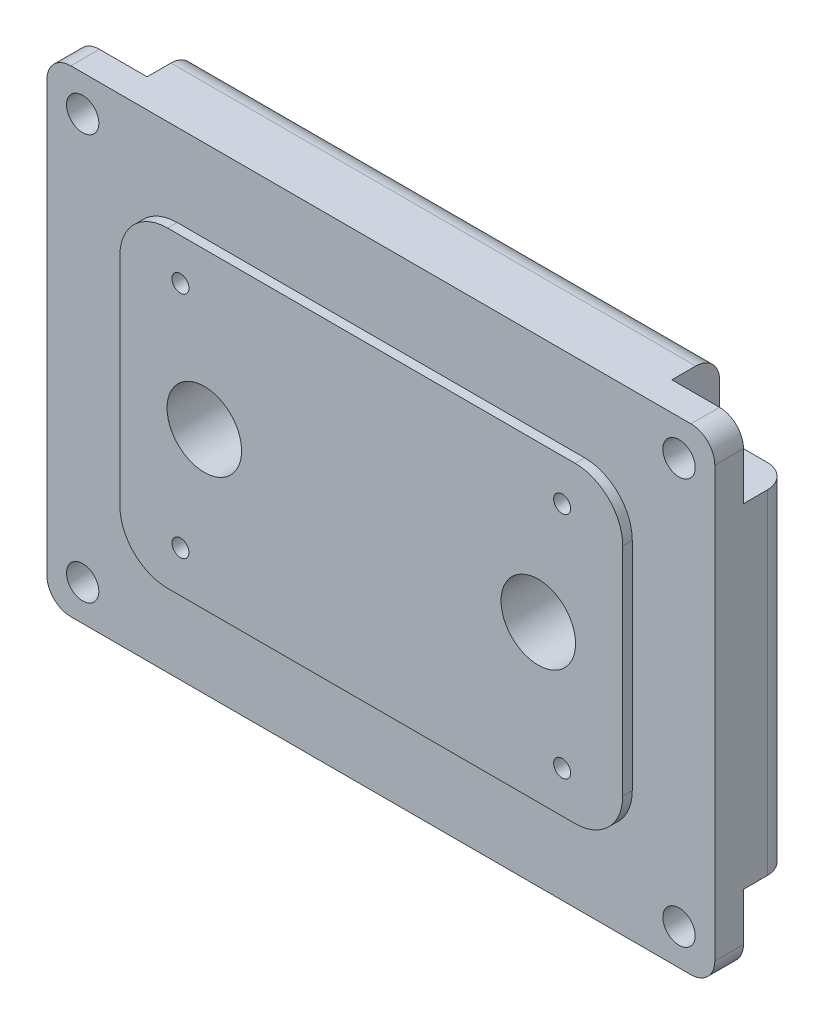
ISO-10303-21;
HEADER;
FILE_DESCRIPTION(('STEP AP214'),'2;1');
FILE_NAME('part.step','',(''),(''),'','','');
FILE_SCHEMA(('AUTOMOTIVE_DESIGN { 1 0 10303 214 1 1 1 1 }'));
ENDSEC;
DATA;
#1=APPLICATION_CONTEXT('core data for automotive mechanical design processes');
#2=APPLICATION_PROTOCOL_DEFINITION('international standard','automotive_design',2000,#1);
#3=PRODUCT_CONTEXT('',#1,'mechanical');
#4=PRODUCT('Part','Part','',(#3));
#5=PRODUCT_RELATED_PRODUCT_CATEGORY('part','',(#4));
#6=PRODUCT_DEFINITION_FORMATION('','',#4);
#7=PRODUCT_DEFINITION_CONTEXT('part definition',#1,'design');
#8=PRODUCT_DEFINITION('design','',#6,#7);
#9=PRODUCT_DEFINITION_SHAPE('','',#8);
#10=(LENGTH_UNIT() NAMED_UNIT(*) SI_UNIT(.MILLI.,.METRE.));
#11=(NAMED_UNIT(*) PLANE_ANGLE_UNIT() SI_UNIT($,.RADIAN.));
#12=(NAMED_UNIT(*) SI_UNIT($,.STERADIAN.) SOLID_ANGLE_UNIT());
#13=UNCERTAINTY_MEASURE_WITH_UNIT(LENGTH_MEASURE(1.E-05),#10,'distance_accuracy_value','');
#14=(GEOMETRIC_REPRESENTATION_CONTEXT(3) GLOBAL_UNCERTAINTY_ASSIGNED_CONTEXT((#13)) GLOBAL_UNIT_ASSIGNED_CONTEXT((#10,
#11,#12)) REPRESENTATION_CONTEXT('',''));
#15=CARTESIAN_POINT('',(0.,0.,0.));
#16=DIRECTION('',(0.,0.,1.));
#17=DIRECTION('',(1.,0.,0.));
#18=AXIS2_PLACEMENT_3D('',#15,#16,#17);
#19=CARTESIAN_POINT('',(0.,0.,0.));
#20=DIRECTION('',(0.,0.,-1.));
#21=DIRECTION('',(-1.,0.,0.));
#22=AXIS2_PLACEMENT_3D('',#19,#20,#21);
#23=PLANE('',#22);
#24=CARTESIAN_POINT('',(8.128,24.765,0.));
#25=DIRECTION('',(0.,0.,-1.));
#26=DIRECTION('',(-1.,0.,0.));
#27=AXIS2_PLACEMENT_3D('',#24,#25,#26);
#28=CIRCLE('',#27,1.72719999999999);
#29=CARTESIAN_POINT('',(6.40080000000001,24.765,0.));
#30=VERTEX_POINT('',#29);
#31=EDGE_CURVE('E321',#30,#30,#28,.T.);
#32=ORIENTED_EDGE('',*,*,#31,.F.);
#33=EDGE_LOOP('',(#32));
#34=FACE_BOUND('',#33,.T.);
#35=CARTESIAN_POINT('',(-8.128,15.875,0.));
#36=DIRECTION('',(0.,0.,-1.));
#37=DIRECTION('',(-1.,0.,0.));
#38=AXIS2_PLACEMENT_3D('',#35,#36,#37);
#39=CIRCLE('',#38,1.72719999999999);
#40=CARTESIAN_POINT('',(-9.85519999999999,15.875,0.));
#41=VERTEX_POINT('',#40);
#42=EDGE_CURVE('E320',#41,#41,#39,.T.);
#43=ORIENTED_EDGE('',*,*,#42,.F.);
#44=EDGE_LOOP('',(#43));
#45=FACE_BOUND('',#44,.T.);
#46=CARTESIAN_POINT('',(8.128,15.875,0.));
#47=DIRECTION('',(0.,0.,-1.));
#48=DIRECTION('',(-1.,0.,0.));
#49=AXIS2_PLACEMENT_3D('',#46,#47,#48);
#50=CIRCLE('',#49,1.72719999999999);
#51=CARTESIAN_POINT('',(6.40080000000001,15.875,0.));
#52=VERTEX_POINT('',#51);
#53=EDGE_CURVE('E331',#52,#52,#50,.T.);
#54=ORIENTED_EDGE('',*,*,#53,.F.);
#55=EDGE_LOOP('',(#54));
#56=FACE_BOUND('',#55,.T.);
#57=CARTESIAN_POINT('',(-8.128,24.765,0.));
#58=DIRECTION('',(0.,0.,-1.));
#59=DIRECTION('',(-1.,0.,0.));
#60=AXIS2_PLACEMENT_3D('',#57,#58,#59);
#61=CIRCLE('',#60,1.72719999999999);
#62=CARTESIAN_POINT('',(-9.85519999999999,24.765,0.));
#63=VERTEX_POINT('',#62);
#64=EDGE_CURVE('E337',#63,#63,#61,.T.);
#65=ORIENTED_EDGE('',*,*,#64,.F.);
#66=EDGE_LOOP('',(#65));
#67=FACE_BOUND('',#66,.T.);
#68=DIRECTION('',(0.,-1.,0.));
#69=VECTOR('',#68,1.);
#70=CARTESIAN_POINT('',(-34.925,-25.4,0.));
#71=LINE('',#70,#69);
#72=CARTESIAN_POINT('',(-34.925,-25.4,0.));
#73=VERTEX_POINT('',#72);
#74=CARTESIAN_POINT('',(-34.925,-28.575,0.));
#75=VERTEX_POINT('',#74);
#76=EDGE_CURVE('E353',#73,#75,#71,.T.);
#77=ORIENTED_EDGE('',*,*,#76,.F.);
#78=CARTESIAN_POINT('',(-38.1,-25.4,0.));
#79=DIRECTION('',(0.,0.,-1.));
#80=DIRECTION('',(-1.,0.,0.));
#81=AXIS2_PLACEMENT_3D('',#78,#79,#80);
#82=CIRCLE('',#81,3.175);
#83=CARTESIAN_POINT('',(-38.1,-22.225,0.));
#84=VERTEX_POINT('',#83);
#85=EDGE_CURVE('E364',#84,#73,#82,.T.);
#86=ORIENTED_EDGE('',*,*,#85,.F.);
#87=DIRECTION('',(1.,0.,0.));
#88=VECTOR('',#87,1.);
#89=CARTESIAN_POINT('',(-44.45,-22.225,0.));
#90=LINE('',#89,#88);
#91=CARTESIAN_POINT('',(-41.275,-22.225,0.));
#92=VERTEX_POINT('',#91);
#93=EDGE_CURVE('E349',#92,#84,#90,.T.);
#94=ORIENTED_EDGE('',*,*,#93,.F.);
#95=DIRECTION('',(0.,-1.,0.));
#96=VECTOR('',#95,1.);
#97=CARTESIAN_POINT('',(-41.275,31.75,0.));
#98=LINE('',#97,#96);
#99=CARTESIAN_POINT('',(-41.275,22.225,0.));
#100=VERTEX_POINT('',#99);
#101=EDGE_CURVE('E76',#92,#100,#98,.F.);
#102=ORIENTED_EDGE('',*,*,#101,.T.);
#103=DIRECTION('',(1.,0.,0.));
#104=VECTOR('',#103,1.);
#105=CARTESIAN_POINT('',(-44.45,22.225,0.));
#106=LINE('',#105,#104);
#107=CARTESIAN_POINT('',(-38.1,22.225,0.));
#108=VERTEX_POINT('',#107);
#109=EDGE_CURVE('E388',#100,#108,#106,.T.);
#110=ORIENTED_EDGE('',*,*,#109,.T.);
#111=CARTESIAN_POINT('',(-38.1,25.4,0.));
#112=DIRECTION('',(0.,0.,1.));
#113=DIRECTION('',(-1.,0.,0.));
#114=AXIS2_PLACEMENT_3D('',#111,#112,#113);
#115=CIRCLE('',#114,3.175);
#116=CARTESIAN_POINT('',(-34.925,25.4,0.));
#117=VERTEX_POINT('',#116);
#118=EDGE_CURVE('E400',#108,#117,#115,.T.);
#119=ORIENTED_EDGE('',*,*,#118,.T.);
#120=DIRECTION('',(0.,1.,0.));
#121=VECTOR('',#120,1.);
#122=CARTESIAN_POINT('',(-34.925,25.4,0.));
#123=LINE('',#122,#121);
#124=CARTESIAN_POINT('',(-34.925,28.575,0.));
#125=VERTEX_POINT('',#124);
#126=EDGE_CURVE('E383',#117,#125,#123,.T.);
#127=ORIENTED_EDGE('',*,*,#126,.T.);
#128=DIRECTION('',(-1.,0.,0.));
#129=VECTOR('',#128,1.);
#130=CARTESIAN_POINT('',(44.45,28.575,0.));
#131=LINE('',#130,#129);
#132=CARTESIAN_POINT('',(34.925,28.575,0.));
#133=VERTEX_POINT('',#132);
#134=EDGE_CURVE('E626',#125,#133,#131,.F.);
#135=ORIENTED_EDGE('',*,*,#134,.T.);
#136=DIRECTION('',(0.,1.,0.));
#137=VECTOR('',#136,1.);
#138=CARTESIAN_POINT('',(34.925,25.4,0.));
#139=LINE('',#138,#137);
#140=CARTESIAN_POINT('',(34.925,25.4,0.));
#141=VERTEX_POINT('',#140);
#142=EDGE_CURVE('E459',#141,#133,#139,.T.);
#143=ORIENTED_EDGE('',*,*,#142,.F.);
#144=CARTESIAN_POINT('',(38.1,25.4,0.));
#145=DIRECTION('',(0.,0.,-1.));
#146=DIRECTION('',(1.,0.,0.));
#147=AXIS2_PLACEMENT_3D('',#144,#145,#146);
#148=CIRCLE('',#147,3.175);
#149=CARTESIAN_POINT('',(38.1,22.225,0.));
#150=VERTEX_POINT('',#149);
#151=EDGE_CURVE('E472',#150,#141,#148,.T.);
#152=ORIENTED_EDGE('',*,*,#151,.F.);
#153=DIRECTION('',(-1.,0.,0.));
#154=VECTOR('',#153,1.);
#155=CARTESIAN_POINT('',(44.45,22.225,0.));
#156=LINE('',#155,#154);
#157=CARTESIAN_POINT('',(41.275,22.225,0.));
#158=VERTEX_POINT('',#157);
#159=EDGE_CURVE('E455',#158,#150,#156,.T.);
#160=ORIENTED_EDGE('',*,*,#159,.F.);
#161=DIRECTION('',(0.,1.,0.));
#162=VECTOR('',#161,1.);
#163=CARTESIAN_POINT('',(41.275,-31.75,0.));
#164=LINE('',#163,#162);
#165=CARTESIAN_POINT('',(41.275,-22.225,0.));
#166=VERTEX_POINT('',#165);
#167=EDGE_CURVE('E628',#158,#166,#164,.F.);
#168=ORIENTED_EDGE('',*,*,#167,.T.);
#169=DIRECTION('',(-1.,0.,0.));
#170=VECTOR('',#169,1.);
#171=CARTESIAN_POINT('',(44.45,-22.225,0.));
#172=LINE('',#171,#170);
#173=CARTESIAN_POINT('',(38.1,-22.225,0.));
#174=VERTEX_POINT('',#173);
#175=EDGE_CURVE('E423',#166,#174,#172,.T.);
#176=ORIENTED_EDGE('',*,*,#175,.T.);
#177=CARTESIAN_POINT('',(38.1,-25.4,0.));
#178=DIRECTION('',(0.,0.,1.));
#179=DIRECTION('',(1.,0.,0.));
#180=AXIS2_PLACEMENT_3D('',#177,#178,#179);
#181=CIRCLE('',#180,3.175);
#182=CARTESIAN_POINT('',(34.925,-25.4,0.));
#183=VERTEX_POINT('',#182);
#184=EDGE_CURVE('E435',#174,#183,#181,.T.);
#185=ORIENTED_EDGE('',*,*,#184,.T.);
#186=DIRECTION('',(0.,-1.,0.));
#187=VECTOR('',#186,1.);
#188=CARTESIAN_POINT('',(34.925,-25.4,0.));
#189=LINE('',#188,#187);
#190=CARTESIAN_POINT('',(34.925,-28.575,0.));
#191=VERTEX_POINT('',#190);
#192=EDGE_CURVE('E418',#183,#191,#189,.T.);
#193=ORIENTED_EDGE('',*,*,#192,.T.);
#194=DIRECTION('',(1.,0.,0.));
#195=VECTOR('',#194,1.);
#196=CARTESIAN_POINT('',(-44.45,-28.575,0.));
#197=LINE('',#196,#195);
#198=EDGE_CURVE('E631',#191,#75,#197,.F.);
#199=ORIENTED_EDGE('',*,*,#198,.T.);
#200=EDGE_LOOP('',(#77,#86,#94,#102,#110,#119,#127,#135,#143,#152,#160,#168,#176,#185,#193,#199));
#201=FACE_BOUND('',#200,.T.);
#202=CARTESIAN_POINT('',(22.225,0.,0.));
#203=DIRECTION('',(0.,0.,-1.));
#204=DIRECTION('',(-1.,0.,0.));
#205=AXIS2_PLACEMENT_3D('',#202,#203,#204);
#206=CIRCLE('',#205,4.96061999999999);
#207=CARTESIAN_POINT('',(17.26438,0.,0.));
#208=VERTEX_POINT('',#207);
#209=EDGE_CURVE('E511',#208,#208,#206,.T.);
#210=ORIENTED_EDGE('',*,*,#209,.F.);
#211=EDGE_LOOP('',(#210));
#212=FACE_BOUND('',#211,.T.);
#213=CARTESIAN_POINT('',(-22.225,0.,0.));
#214=DIRECTION('',(0.,0.,-1.));
#215=DIRECTION('',(-1.,0.,0.));
#216=AXIS2_PLACEMENT_3D('',#213,#214,#215);
#217=CIRCLE('',#216,4.96061999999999);
#218=CARTESIAN_POINT('',(-27.18562,0.,0.));
#219=VERTEX_POINT('',#218);
#220=EDGE_CURVE('E517',#219,#219,#217,.T.);
#221=ORIENTED_EDGE('',*,*,#220,.F.);
#222=EDGE_LOOP('',(#221));
#223=FACE_BOUND('',#222,.T.);
#224=ADVANCED_FACE('F53',(#34,#45,#56,#67,#201,#212,#223),#23,.T.);
#225=CARTESIAN_POINT('',(-44.45,-31.75,10.16));
#226=DIRECTION('',(1.,0.,0.));
#227=DIRECTION('',(0.,1.,0.));
#228=AXIS2_PLACEMENT_3D('',#225,#226,#227);
#229=PLANE('',#228);
#230=DIRECTION('',(0.,-1.,0.));
#231=VECTOR('',#230,1.);
#232=CARTESIAN_POINT('',(-44.45,-31.75,3.175));
#233=LINE('',#232,#231);
#234=CARTESIAN_POINT('',(-44.45,22.225,3.175));
#235=VERTEX_POINT('',#234);
#236=CARTESIAN_POINT('',(-44.45,-22.225,3.175));
#237=VERTEX_POINT('',#236);
#238=EDGE_CURVE('E602',#235,#237,#233,.T.);
#239=ORIENTED_EDGE('',*,*,#238,.T.);
#240=DIRECTION('',(0.,0.,-1.));
#241=VECTOR('',#240,1.);
#242=CARTESIAN_POINT('',(-44.45,-22.225,6.35));
#243=LINE('',#242,#241);
#244=CARTESIAN_POINT('',(-44.45,-22.225,6.35));
#245=VERTEX_POINT('',#244);
#246=EDGE_CURVE('E362',#245,#237,#243,.T.);
#247=ORIENTED_EDGE('',*,*,#246,.F.);
#248=DIRECTION('',(0.,1.,0.));
#249=VECTOR('',#248,1.);
#250=CARTESIAN_POINT('',(-44.45,-22.225,6.35));
#251=LINE('',#250,#249);
#252=CARTESIAN_POINT('',(-44.45,-28.575,6.35));
#253=VERTEX_POINT('',#252);
#254=EDGE_CURVE('E350',#253,#245,#251,.T.);
#255=ORIENTED_EDGE('',*,*,#254,.F.);
#256=DIRECTION('',(0.,0.,-1.));
#257=VECTOR('',#256,1.);
#258=CARTESIAN_POINT('',(-44.45,-28.575,10.16));
#259=LINE('',#258,#257);
#260=CARTESIAN_POINT('',(-44.45,-28.575,10.16));
#261=VERTEX_POINT('',#260);
#262=EDGE_CURVE('E608',#253,#261,#259,.F.);
#263=ORIENTED_EDGE('',*,*,#262,.T.);
#264=DIRECTION('',(0.,-1.,0.));
#265=VECTOR('',#264,1.);
#266=CARTESIAN_POINT('',(-44.45,-31.75,10.16));
#267=LINE('',#266,#265);
#268=CARTESIAN_POINT('',(-44.45,28.575,10.16));
#269=VERTEX_POINT('',#268);
#270=EDGE_CURVE('E537',#269,#261,#267,.T.);
#271=ORIENTED_EDGE('',*,*,#270,.F.);
#272=DIRECTION('',(0.,0.,-1.));
#273=VECTOR('',#272,1.);
#274=CARTESIAN_POINT('',(-44.45,28.575,10.16));
#275=LINE('',#274,#273);
#276=CARTESIAN_POINT('',(-44.45,28.575,6.35));
#277=VERTEX_POINT('',#276);
#278=EDGE_CURVE('E605',#269,#277,#275,.T.);
#279=ORIENTED_EDGE('',*,*,#278,.T.);
#280=DIRECTION('',(0.,-1.,0.));
#281=VECTOR('',#280,1.);
#282=CARTESIAN_POINT('',(-44.45,22.225,6.35));
#283=LINE('',#282,#281);
#284=CARTESIAN_POINT('',(-44.45,22.225,6.35));
#285=VERTEX_POINT('',#284);
#286=EDGE_CURVE('E384',#277,#285,#283,.T.);
#287=ORIENTED_EDGE('',*,*,#286,.T.);
#288=DIRECTION('',(0.,0.,-1.));
#289=VECTOR('',#288,1.);
#290=CARTESIAN_POINT('',(-44.45,22.225,6.35));
#291=LINE('',#290,#289);
#292=EDGE_CURVE('E404',#285,#235,#291,.T.);
#293=ORIENTED_EDGE('',*,*,#292,.T.);
#294=EDGE_LOOP('',(#239,#247,#255,#263,#271,#279,#287,#293));
#295=FACE_BOUND('',#294,.T.);
#296=ADVANCED_FACE('F726',(#295),#229,.F.);
#297=CARTESIAN_POINT('',(-44.45,31.75,10.16));
#298=DIRECTION('',(0.,-1.,0.));
#299=DIRECTION('',(1.,0.,0.));
#300=AXIS2_PLACEMENT_3D('',#297,#298,#299);
#301=PLANE('',#300);
#302=DIRECTION('',(0.,0.,-1.));
#303=VECTOR('',#302,1.);
#304=CARTESIAN_POINT('',(-34.925,31.75,6.35));
#305=LINE('',#304,#303);
#306=CARTESIAN_POINT('',(-34.925,31.75,6.35));
#307=VERTEX_POINT('',#306);
#308=CARTESIAN_POINT('',(-34.925,31.75,3.175));
#309=VERTEX_POINT('',#308);
#310=EDGE_CURVE('E397',#307,#309,#305,.T.);
#311=ORIENTED_EDGE('',*,*,#310,.F.);
#312=DIRECTION('',(-1.,0.,0.));
#313=VECTOR('',#312,1.);
#314=CARTESIAN_POINT('',(-44.45,31.75,6.35));
#315=LINE('',#314,#313);
#316=CARTESIAN_POINT('',(-41.275,31.75,6.35));
#317=VERTEX_POINT('',#316);
#318=EDGE_CURVE('E387',#307,#317,#315,.T.);
#319=ORIENTED_EDGE('',*,*,#318,.T.);
#320=DIRECTION('',(0.,0.,-1.));
#321=VECTOR('',#320,1.);
#322=CARTESIAN_POINT('',(-41.275,31.75,10.16));
#323=LINE('',#322,#321);
#324=CARTESIAN_POINT('',(-41.275,31.75,10.16));
#325=VERTEX_POINT('',#324);
#326=EDGE_CURVE('E624',#317,#325,#323,.F.);
#327=ORIENTED_EDGE('',*,*,#326,.T.);
#328=DIRECTION('',(-1.,0.,0.));
#329=VECTOR('',#328,1.);
#330=CARTESIAN_POINT('',(-44.45,31.75,10.16));
#331=LINE('',#330,#329);
#332=CARTESIAN_POINT('',(41.275,31.75,10.16));
#333=VERTEX_POINT('',#332);
#334=EDGE_CURVE('E556',#333,#325,#331,.T.);
#335=ORIENTED_EDGE('',*,*,#334,.F.);
#336=DIRECTION('',(0.,0.,-1.));
#337=VECTOR('',#336,1.);
#338=CARTESIAN_POINT('',(41.275,31.75,10.16));
#339=LINE('',#338,#337);
#340=CARTESIAN_POINT('',(41.275,31.75,6.35));
#341=VERTEX_POINT('',#340);
#342=EDGE_CURVE('E621',#333,#341,#339,.T.);
#343=ORIENTED_EDGE('',*,*,#342,.T.);
#344=DIRECTION('',(1.,0.,0.));
#345=VECTOR('',#344,1.);
#346=CARTESIAN_POINT('',(44.45,31.75,6.35));
#347=LINE('',#346,#345);
#348=CARTESIAN_POINT('',(34.925,31.75,6.35));
#349=VERTEX_POINT('',#348);
#350=EDGE_CURVE('E468',#349,#341,#347,.T.);
#351=ORIENTED_EDGE('',*,*,#350,.F.);
#352=DIRECTION('',(0.,0.,-1.));
#353=VECTOR('',#352,1.);
#354=CARTESIAN_POINT('',(34.925,31.75,6.35));
#355=LINE('',#354,#353);
#356=CARTESIAN_POINT('',(34.925,31.75,3.175));
#357=VERTEX_POINT('',#356);
#358=EDGE_CURVE('E477',#349,#357,#355,.T.);
#359=ORIENTED_EDGE('',*,*,#358,.T.);
#360=DIRECTION('',(-1.,0.,0.));
#361=VECTOR('',#360,1.);
#362=CARTESIAN_POINT('',(-44.45,31.75,3.175));
#363=LINE('',#362,#361);
#364=EDGE_CURVE('E618',#357,#309,#363,.T.);
#365=ORIENTED_EDGE('',*,*,#364,.T.);
#366=EDGE_LOOP('',(#311,#319,#327,#335,#343,#351,#359,#365));
#367=FACE_BOUND('',#366,.T.);
#368=ADVANCED_FACE('F715',(#367),#301,.F.);
#369=CARTESIAN_POINT('',(-44.45,28.575,3.175));
#370=DIRECTION('',(1.,0.,0.));
#371=DIRECTION('',(0.,1.,0.));
#372=AXIS2_PLACEMENT_3D('',#369,#370,#371);
#373=CYLINDRICAL_SURFACE('',#372,3.175);
#374=ORIENTED_EDGE('',*,*,#134,.F.);
#375=CARTESIAN_POINT('',(-34.925,28.575,3.175));
#376=DIRECTION('',(-1.,0.,0.));
#377=DIRECTION('',(0.,0.,1.));
#378=AXIS2_PLACEMENT_3D('',#375,#376,#377);
#379=CIRCLE('',#378,3.175);
#380=EDGE_CURVE('E661',#125,#309,#379,.F.);
#381=ORIENTED_EDGE('',*,*,#380,.T.);
#382=ORIENTED_EDGE('',*,*,#364,.F.);
#383=CARTESIAN_POINT('',(34.925,28.575,3.175));
#384=DIRECTION('',(-1.,0.,0.));
#385=DIRECTION('',(0.,0.,1.));
#386=AXIS2_PLACEMENT_3D('',#383,#384,#385);
#387=CIRCLE('',#386,3.175);
#388=EDGE_CURVE('E642',#133,#357,#387,.F.);
#389=ORIENTED_EDGE('',*,*,#388,.F.);
#390=EDGE_LOOP('',(#374,#381,#382,#389));
#391=FACE_BOUND('',#390,.T.);
#392=ADVANCED_FACE('F769',(#391),#373,.T.);
#393=CARTESIAN_POINT('',(-41.275,-31.75,3.175));
#394=DIRECTION('',(0.,1.,0.));
#395=DIRECTION('',(-1.,0.,0.));
#396=AXIS2_PLACEMENT_3D('',#393,#394,#395);
#397=CYLINDRICAL_SURFACE('',#396,3.175);
#398=CARTESIAN_POINT('',(-41.275,-22.225,3.175));
#399=DIRECTION('',(0.,1.,0.));
#400=DIRECTION('',(-1.,0.,0.));
#401=AXIS2_PLACEMENT_3D('',#398,#399,#400);
#402=CIRCLE('',#401,3.175);
#403=EDGE_CURVE('E13',#237,#92,#402,.F.);
#404=ORIENTED_EDGE('',*,*,#403,.F.);
#405=ORIENTED_EDGE('',*,*,#238,.F.);
#406=CARTESIAN_POINT('',(-41.275,22.225,3.175));
#407=DIRECTION('',(0.,1.,0.));
#408=DIRECTION('',(-1.,0.,0.));
#409=AXIS2_PLACEMENT_3D('',#406,#407,#408);
#410=CIRCLE('',#409,3.175);
#411=EDGE_CURVE('E656',#235,#100,#410,.F.);
#412=ORIENTED_EDGE('',*,*,#411,.T.);
#413=ORIENTED_EDGE('',*,*,#101,.F.);
#414=EDGE_LOOP('',(#404,#405,#412,#413));
#415=FACE_BOUND('',#414,.T.);
#416=ADVANCED_FACE('F742',(#415),#397,.T.);
#417=CARTESIAN_POINT('',(-44.45,-31.75,10.16));
#418=DIRECTION('',(0.,1.,0.));
#419=DIRECTION('',(0.,0.,1.));
#420=AXIS2_PLACEMENT_3D('',#417,#418,#419);
#421=PLANE('',#420);
#422=DIRECTION('',(-1.,0.,0.));
#423=VECTOR('',#422,1.);
#424=CARTESIAN_POINT('',(-44.45,-31.75,6.35));
#425=LINE('',#424,#423);
#426=CARTESIAN_POINT('',(-34.925,-31.75,6.35));
#427=VERTEX_POINT('',#426);
#428=CARTESIAN_POINT('',(-41.275,-31.75,6.35));
#429=VERTEX_POINT('',#428);
#430=EDGE_CURVE('E68',#427,#429,#425,.T.);
#431=ORIENTED_EDGE('',*,*,#430,.F.);
#432=DIRECTION('',(0.,0.,-1.));
#433=VECTOR('',#432,1.);
#434=CARTESIAN_POINT('',(-34.925,-31.75,6.35));
#435=LINE('',#434,#433);
#436=CARTESIAN_POINT('',(-34.925,-31.75,3.175));
#437=VERTEX_POINT('',#436);
#438=EDGE_CURVE('E368',#427,#437,#435,.T.);
#439=ORIENTED_EDGE('',*,*,#438,.T.);
#440=DIRECTION('',(1.,0.,0.));
#441=VECTOR('',#440,1.);
#442=CARTESIAN_POINT('',(44.45,-31.75,3.175));
#443=LINE('',#442,#441);
#444=CARTESIAN_POINT('',(34.925,-31.75,3.175));
#445=VERTEX_POINT('',#444);
#446=EDGE_CURVE('E597',#437,#445,#443,.T.);
#447=ORIENTED_EDGE('',*,*,#446,.T.);
#448=DIRECTION('',(0.,0.,-1.));
#449=VECTOR('',#448,1.);
#450=CARTESIAN_POINT('',(34.925,-31.75,6.35));
#451=LINE('',#450,#449);
#452=CARTESIAN_POINT('',(34.925,-31.75,6.35));
#453=VERTEX_POINT('',#452);
#454=EDGE_CURVE('E432',#453,#445,#451,.T.);
#455=ORIENTED_EDGE('',*,*,#454,.F.);
#456=DIRECTION('',(1.,0.,0.));
#457=VECTOR('',#456,1.);
#458=CARTESIAN_POINT('',(44.45,-31.75,6.35));
#459=LINE('',#458,#457);
#460=CARTESIAN_POINT('',(41.275,-31.75,6.35));
#461=VERTEX_POINT('',#460);
#462=EDGE_CURVE('E422',#453,#461,#459,.T.);
#463=ORIENTED_EDGE('',*,*,#462,.T.);
#464=DIRECTION('',(0.,0.,-1.));
#465=VECTOR('',#464,1.);
#466=CARTESIAN_POINT('',(41.275,-31.75,10.16));
#467=LINE('',#466,#465);
#468=CARTESIAN_POINT('',(41.275,-31.75,10.16));
#469=VERTEX_POINT('',#468);
#470=EDGE_CURVE('E595',#461,#469,#467,.F.);
#471=ORIENTED_EDGE('',*,*,#470,.T.);
#472=DIRECTION('',(1.,0.,0.));
#473=VECTOR('',#472,1.);
#474=CARTESIAN_POINT('',(-44.45,-31.75,10.16));
#475=LINE('',#474,#473);
#476=CARTESIAN_POINT('',(-41.275,-31.75,10.16));
#477=VERTEX_POINT('',#476);
#478=EDGE_CURVE('E550',#477,#469,#475,.T.);
#479=ORIENTED_EDGE('',*,*,#478,.F.);
#480=DIRECTION('',(0.,0.,-1.));
#481=VECTOR('',#480,1.);
#482=CARTESIAN_POINT('',(-41.275,-31.75,10.16));
#483=LINE('',#482,#481);
#484=EDGE_CURVE('E599',#477,#429,#483,.T.);
#485=ORIENTED_EDGE('',*,*,#484,.T.);
#486=EDGE_LOOP('',(#431,#439,#447,#455,#463,#471,#479,#485));
#487=FACE_BOUND('',#486,.T.);
#488=ADVANCED_FACE('F674',(#487),#421,.F.);
#489=CARTESIAN_POINT('',(44.45,-31.75,10.16));
#490=DIRECTION('',(-1.,0.,0.));
#491=DIRECTION('',(0.,-1.,0.));
#492=AXIS2_PLACEMENT_3D('',#489,#490,#491);
#493=PLANE('',#492);
#494=DIRECTION('',(0.,0.,-1.));
#495=VECTOR('',#494,1.);
#496=CARTESIAN_POINT('',(44.45,-22.225,6.35));
#497=LINE('',#496,#495);
#498=CARTESIAN_POINT('',(44.45,-22.225,6.35));
#499=VERTEX_POINT('',#498);
#500=CARTESIAN_POINT('',(44.45,-22.225,3.175));
#501=VERTEX_POINT('',#500);
#502=EDGE_CURVE('E440',#499,#501,#497,.T.);
#503=ORIENTED_EDGE('',*,*,#502,.T.);
#504=DIRECTION('',(0.,1.,0.));
#505=VECTOR('',#504,1.);
#506=CARTESIAN_POINT('',(44.45,31.75,3.175));
#507=LINE('',#506,#505);
#508=CARTESIAN_POINT('',(44.45,22.225,3.175));
#509=VERTEX_POINT('',#508);
#510=EDGE_CURVE('E637',#501,#509,#507,.T.);
#511=ORIENTED_EDGE('',*,*,#510,.T.);
#512=DIRECTION('',(0.,0.,-1.));
#513=VECTOR('',#512,1.);
#514=CARTESIAN_POINT('',(44.45,22.225,6.35));
#515=LINE('',#514,#513);
#516=CARTESIAN_POINT('',(44.45,22.225,6.35));
#517=VERTEX_POINT('',#516);
#518=EDGE_CURVE('E470',#517,#509,#515,.T.);
#519=ORIENTED_EDGE('',*,*,#518,.F.);
#520=DIRECTION('',(0.,-1.,0.));
#521=VECTOR('',#520,1.);
#522=CARTESIAN_POINT('',(44.45,22.225,6.35));
#523=LINE('',#522,#521);
#524=CARTESIAN_POINT('',(44.45,28.575,6.35));
#525=VERTEX_POINT('',#524);
#526=EDGE_CURVE('E456',#525,#517,#523,.T.);
#527=ORIENTED_EDGE('',*,*,#526,.F.);
#528=DIRECTION('',(0.,0.,-1.));
#529=VECTOR('',#528,1.);
#530=CARTESIAN_POINT('',(44.45,28.575,10.16));
#531=LINE('',#530,#529);
#532=CARTESIAN_POINT('',(44.45,28.575,10.16));
#533=VERTEX_POINT('',#532);
#534=EDGE_CURVE('E635',#525,#533,#531,.F.);
#535=ORIENTED_EDGE('',*,*,#534,.T.);
#536=DIRECTION('',(0.,1.,0.));
#537=VECTOR('',#536,1.);
#538=CARTESIAN_POINT('',(44.45,-31.75,10.16));
#539=LINE('',#538,#537);
#540=CARTESIAN_POINT('',(44.45,-28.575,10.16));
#541=VERTEX_POINT('',#540);
#542=EDGE_CURVE('E553',#541,#533,#539,.T.);
#543=ORIENTED_EDGE('',*,*,#542,.F.);
#544=DIRECTION('',(0.,0.,-1.));
#545=VECTOR('',#544,1.);
#546=CARTESIAN_POINT('',(44.45,-28.575,10.16));
#547=LINE('',#546,#545);
#548=CARTESIAN_POINT('',(44.45,-28.575,6.35));
#549=VERTEX_POINT('',#548);
#550=EDGE_CURVE('E639',#541,#549,#547,.T.);
#551=ORIENTED_EDGE('',*,*,#550,.T.);
#552=DIRECTION('',(0.,1.,0.));
#553=VECTOR('',#552,1.);
#554=CARTESIAN_POINT('',(44.45,-22.225,6.35));
#555=LINE('',#554,#553);
#556=EDGE_CURVE('E419',#549,#499,#555,.T.);
#557=ORIENTED_EDGE('',*,*,#556,.T.);
#558=EDGE_LOOP('',(#503,#511,#519,#527,#535,#543,#551,#557));
#559=FACE_BOUND('',#558,.T.);
#560=ADVANCED_FACE('F704',(#559),#493,.F.);
#561=CARTESIAN_POINT('',(41.275,-31.75,3.175));
#562=DIRECTION('',(0.,-1.,0.));
#563=DIRECTION('',(1.,0.,0.));
#564=AXIS2_PLACEMENT_3D('',#561,#562,#563);
#565=CYLINDRICAL_SURFACE('',#564,3.175);
#566=ORIENTED_EDGE('',*,*,#510,.F.);
#567=CARTESIAN_POINT('',(41.275,-22.225,3.175));
#568=DIRECTION('',(0.,-1.,0.));
#569=DIRECTION('',(1.,0.,0.));
#570=AXIS2_PLACEMENT_3D('',#567,#568,#569);
#571=CIRCLE('',#570,3.175);
#572=EDGE_CURVE('E651',#501,#166,#571,.F.);
#573=ORIENTED_EDGE('',*,*,#572,.T.);
#574=ORIENTED_EDGE('',*,*,#167,.F.);
#575=CARTESIAN_POINT('',(41.275,22.225,3.175));
#576=DIRECTION('',(0.,-1.,0.));
#577=DIRECTION('',(1.,0.,0.));
#578=AXIS2_PLACEMENT_3D('',#575,#576,#577);
#579=CIRCLE('',#578,3.175);
#580=EDGE_CURVE('E644',#509,#158,#579,.F.);
#581=ORIENTED_EDGE('',*,*,#580,.F.);
#582=EDGE_LOOP('',(#566,#573,#574,#581));
#583=FACE_BOUND('',#582,.T.);
#584=ADVANCED_FACE('F772',(#583),#565,.T.);
#585=CARTESIAN_POINT('',(-44.45,-28.575,3.175));
#586=DIRECTION('',(-1.,0.,0.));
#587=DIRECTION('',(0.,0.,1.));
#588=AXIS2_PLACEMENT_3D('',#585,#586,#587);
#589=CYLINDRICAL_SURFACE('',#588,3.175);
#590=CARTESIAN_POINT('',(-34.925,-28.575,3.175));
#591=DIRECTION('',(1.,0.,0.));
#592=DIRECTION('',(0.,0.,-1.));
#593=AXIS2_PLACEMENT_3D('',#590,#591,#592);
#594=CIRCLE('',#593,3.175);
#595=EDGE_CURVE('E61',#75,#437,#594,.F.);
#596=ORIENTED_EDGE('',*,*,#595,.F.);
#597=ORIENTED_EDGE('',*,*,#198,.F.);
#598=CARTESIAN_POINT('',(34.925,-28.575,3.175));
#599=DIRECTION('',(1.,0.,0.));
#600=DIRECTION('',(0.,0.,-1.));
#601=AXIS2_PLACEMENT_3D('',#598,#599,#600);
#602=CIRCLE('',#601,3.175);
#603=EDGE_CURVE('E648',#191,#445,#602,.F.);
#604=ORIENTED_EDGE('',*,*,#603,.T.);
#605=ORIENTED_EDGE('',*,*,#446,.F.);
#606=EDGE_LOOP('',(#596,#597,#604,#605));
#607=FACE_BOUND('',#606,.T.);
#608=ADVANCED_FACE('F676',(#607),#589,.T.);
#609=CARTESIAN_POINT('',(0.,0.,10.16));
#610=DIRECTION('',(0.,0.,-1.));
#611=DIRECTION('',(-1.,0.,0.));
#612=AXIS2_PLACEMENT_3D('',#609,#610,#611);
#613=PLANE('',#612);
#614=CARTESIAN_POINT('',(-39.6875,-26.9875,10.16));
#615=DIRECTION('',(0.,0.,-1.));
#616=DIRECTION('',(-1.,0.,0.));
#617=AXIS2_PLACEMENT_3D('',#614,#615,#616);
#618=CIRCLE('',#617,2.15265);
#619=CARTESIAN_POINT('',(-41.84015,-26.9875,10.16));
#620=VERTEX_POINT('',#619);
#621=EDGE_CURVE('E346',#620,#620,#618,.T.);
#622=ORIENTED_EDGE('',*,*,#621,.T.);
#623=EDGE_LOOP('',(#622));
#624=FACE_BOUND('',#623,.T.);
#625=CARTESIAN_POINT('',(-39.6875,26.9875,10.16));
#626=DIRECTION('',(0.,0.,-1.));
#627=DIRECTION('',(-1.,0.,0.));
#628=AXIS2_PLACEMENT_3D('',#625,#626,#627);
#629=CIRCLE('',#628,2.15265);
#630=CARTESIAN_POINT('',(-41.84015,26.9875,10.16));
#631=VERTEX_POINT('',#630);
#632=EDGE_CURVE('E380',#631,#631,#629,.T.);
#633=ORIENTED_EDGE('',*,*,#632,.T.);
#634=EDGE_LOOP('',(#633));
#635=FACE_BOUND('',#634,.T.);
#636=CARTESIAN_POINT('',(39.6875,-26.9875,10.16));
#637=DIRECTION('',(0.,0.,-1.));
#638=DIRECTION('',(-1.,0.,0.));
#639=AXIS2_PLACEMENT_3D('',#636,#637,#638);
#640=CIRCLE('',#639,2.15265);
#641=CARTESIAN_POINT('',(37.53485,-26.9875,10.16));
#642=VERTEX_POINT('',#641);
#643=EDGE_CURVE('E415',#642,#642,#640,.T.);
#644=ORIENTED_EDGE('',*,*,#643,.T.);
#645=EDGE_LOOP('',(#644));
#646=FACE_BOUND('',#645,.T.);
#647=CARTESIAN_POINT('',(39.6875,26.9875,10.16));
#648=DIRECTION('',(0.,0.,-1.));
#649=DIRECTION('',(-1.,0.,0.));
#650=AXIS2_PLACEMENT_3D('',#647,#648,#649);
#651=CIRCLE('',#650,2.15265);
#652=CARTESIAN_POINT('',(37.53485,26.9875,10.16));
#653=VERTEX_POINT('',#652);
#654=EDGE_CURVE('E452',#653,#653,#651,.T.);
#655=ORIENTED_EDGE('',*,*,#654,.T.);
#656=EDGE_LOOP('',(#655));
#657=FACE_BOUND('',#656,.T.);
#658=ORIENTED_EDGE('',*,*,#270,.T.);
#659=CARTESIAN_POINT('',(-41.275,-28.575,10.16));
#660=DIRECTION('',(0.,0.,-1.));
#661=DIRECTION('',(-1.,0.,0.));
#662=AXIS2_PLACEMENT_3D('',#659,#660,#661);
#663=CIRCLE('',#662,3.175);
#664=EDGE_CURVE('E616',#261,#477,#663,.F.);
#665=ORIENTED_EDGE('',*,*,#664,.T.);
#666=ORIENTED_EDGE('',*,*,#478,.T.);
#667=CARTESIAN_POINT('',(41.275,-28.575,10.16));
#668=DIRECTION('',(0.,0.,-1.));
#669=DIRECTION('',(-1.,0.,0.));
#670=AXIS2_PLACEMENT_3D('',#667,#668,#669);
#671=CIRCLE('',#670,3.175);
#672=EDGE_CURVE('E612',#469,#541,#671,.F.);
#673=ORIENTED_EDGE('',*,*,#672,.T.);
#674=ORIENTED_EDGE('',*,*,#542,.T.);
#675=CARTESIAN_POINT('',(41.275,28.575,10.16));
#676=DIRECTION('',(0.,0.,-1.));
#677=DIRECTION('',(-1.,0.,0.));
#678=AXIS2_PLACEMENT_3D('',#675,#676,#677);
#679=CIRCLE('',#678,3.175);
#680=EDGE_CURVE('E610',#533,#333,#679,.F.);
#681=ORIENTED_EDGE('',*,*,#680,.T.);
#682=ORIENTED_EDGE('',*,*,#334,.T.);
#683=CARTESIAN_POINT('',(-41.275,28.575,10.16));
#684=DIRECTION('',(0.,0.,-1.));
#685=DIRECTION('',(-1.,0.,0.));
#686=AXIS2_PLACEMENT_3D('',#683,#684,#685);
#687=CIRCLE('',#686,3.175);
#688=EDGE_CURVE('E614',#325,#269,#687,.F.);
#689=ORIENTED_EDGE('',*,*,#688,.T.);
#690=EDGE_LOOP('',(#658,#665,#666,#673,#674,#681,#682,#689));
#691=FACE_BOUND('',#690,.T.);
#692=DIRECTION('',(0.,-1.,0.));
#693=VECTOR('',#692,1.);
#694=CARTESIAN_POINT('',(-33.4645,-20.7645,10.16));
#695=LINE('',#694,#693);
#696=CARTESIAN_POINT('',(-33.4645,14.4145,10.16));
#697=VERTEX_POINT('',#696);
#698=CARTESIAN_POINT('',(-33.4645,-14.4145,10.16));
#699=VERTEX_POINT('',#698);
#700=EDGE_CURVE('E523',#697,#699,#695,.T.);
#701=ORIENTED_EDGE('',*,*,#700,.F.);
#702=CARTESIAN_POINT('',(-27.1145,14.4145,10.16));
#703=DIRECTION('',(0.,0.,-1.));
#704=DIRECTION('',(-1.,0.,0.));
#705=AXIS2_PLACEMENT_3D('',#702,#703,#704);
#706=CIRCLE('',#705,6.35);
#707=CARTESIAN_POINT('',(-27.1145,20.7645,10.16));
#708=VERTEX_POINT('',#707);
#709=EDGE_CURVE('E593',#697,#708,#706,.T.);
#710=ORIENTED_EDGE('',*,*,#709,.T.);
#711=DIRECTION('',(-1.,0.,0.));
#712=VECTOR('',#711,1.);
#713=CARTESIAN_POINT('',(-33.4645,20.7645,10.16));
#714=LINE('',#713,#712);
#715=CARTESIAN_POINT('',(27.1145,20.7645,10.16));
#716=VERTEX_POINT('',#715);
#717=EDGE_CURVE('E528',#716,#708,#714,.T.);
#718=ORIENTED_EDGE('',*,*,#717,.F.);
#719=CARTESIAN_POINT('',(27.1145,14.4145,10.16));
#720=DIRECTION('',(0.,0.,-1.));
#721=DIRECTION('',(-1.,0.,0.));
#722=AXIS2_PLACEMENT_3D('',#719,#720,#721);
#723=CIRCLE('',#722,6.35);
#724=CARTESIAN_POINT('',(33.4645,14.4145,10.16));
#725=VERTEX_POINT('',#724);
#726=EDGE_CURVE('E591',#716,#725,#723,.T.);
#727=ORIENTED_EDGE('',*,*,#726,.T.);
#728=DIRECTION('',(0.,1.,0.));
#729=VECTOR('',#728,1.);
#730=CARTESIAN_POINT('',(33.4645,-20.7645,10.16));
#731=LINE('',#730,#729);
#732=CARTESIAN_POINT('',(33.4645,-14.4145,10.16));
#733=VERTEX_POINT('',#732);
#734=EDGE_CURVE('E543',#733,#725,#731,.T.);
#735=ORIENTED_EDGE('',*,*,#734,.F.);
#736=CARTESIAN_POINT('',(27.1145,-14.4145,10.16));
#737=DIRECTION('',(0.,0.,-1.));
#738=DIRECTION('',(-1.,0.,0.));
#739=AXIS2_PLACEMENT_3D('',#736,#737,#738);
#740=CIRCLE('',#739,6.35);
#741=CARTESIAN_POINT('',(27.1145,-20.7645,10.16));
#742=VERTEX_POINT('',#741);
#743=EDGE_CURVE('E589',#733,#742,#740,.T.);
#744=ORIENTED_EDGE('',*,*,#743,.T.);
#745=DIRECTION('',(1.,0.,0.));
#746=VECTOR('',#745,1.);
#747=CARTESIAN_POINT('',(-33.4645,-20.7645,10.16));
#748=LINE('',#747,#746);
#749=CARTESIAN_POINT('',(-27.1145,-20.7645,10.16));
#750=VERTEX_POINT('',#749);
#751=EDGE_CURVE('E540',#750,#742,#748,.T.);
#752=ORIENTED_EDGE('',*,*,#751,.F.);
#753=CARTESIAN_POINT('',(-27.1145,-14.4145,10.16));
#754=DIRECTION('',(0.,0.,-1.));
#755=DIRECTION('',(-1.,0.,0.));
#756=AXIS2_PLACEMENT_3D('',#753,#754,#755);
#757=CIRCLE('',#756,6.35);
#758=EDGE_CURVE('E587',#750,#699,#757,.T.);
#759=ORIENTED_EDGE('',*,*,#758,.T.);
#760=EDGE_LOOP('',(#701,#710,#718,#727,#735,#744,#752,#759));
#761=FACE_BOUND('',#760,.T.);
#762=ADVANCED_FACE('F700',(#624,#635,#646,#657,#691,#761),#613,.F.);
#763=CARTESIAN_POINT('',(-33.4645,-20.7645,11.43));
#764=DIRECTION('',(1.,0.,0.));
#765=DIRECTION('',(0.,1.,0.));
#766=AXIS2_PLACEMENT_3D('',#763,#764,#765);
#767=PLANE('',#766);
#768=ORIENTED_EDGE('',*,*,#700,.T.);
#769=DIRECTION('',(0.,0.,-1.));
#770=VECTOR('',#769,1.);
#771=CARTESIAN_POINT('',(-33.4645,-14.4145,11.43));
#772=LINE('',#771,#770);
#773=CARTESIAN_POINT('',(-33.4645,-14.4145,11.43));
#774=VERTEX_POINT('',#773);
#775=EDGE_CURVE('E567',#699,#774,#772,.F.);
#776=ORIENTED_EDGE('',*,*,#775,.T.);
#777=DIRECTION('',(0.,-1.,0.));
#778=VECTOR('',#777,1.);
#779=CARTESIAN_POINT('',(-33.4645,-20.7645,11.43));
#780=LINE('',#779,#778);
#781=CARTESIAN_POINT('',(-33.4645,14.4145,11.43));
#782=VERTEX_POINT('',#781);
#783=EDGE_CURVE('E524',#782,#774,#780,.T.);
#784=ORIENTED_EDGE('',*,*,#783,.F.);
#785=DIRECTION('',(0.,0.,-1.));
#786=VECTOR('',#785,1.);
#787=CARTESIAN_POINT('',(-33.4645,14.4145,11.43));
#788=LINE('',#787,#786);
#789=EDGE_CURVE('E564',#782,#697,#788,.T.);
#790=ORIENTED_EDGE('',*,*,#789,.T.);
#791=EDGE_LOOP('',(#768,#776,#784,#790));
#792=FACE_BOUND('',#791,.T.);
#793=ADVANCED_FACE('F878',(#792),#767,.F.);
#794=CARTESIAN_POINT('',(-33.4645,-20.7645,11.43));
#795=DIRECTION('',(0.,1.,0.));
#796=DIRECTION('',(-1.,0.,0.));
#797=AXIS2_PLACEMENT_3D('',#794,#795,#796);
#798=PLANE('',#797);
#799=DIRECTION('',(1.,0.,0.));
#800=VECTOR('',#799,1.);
#801=CARTESIAN_POINT('',(-33.4645,-20.7645,11.43));
#802=LINE('',#801,#800);
#803=CARTESIAN_POINT('',(-27.1145,-20.7645,11.43));
#804=VERTEX_POINT('',#803);
#805=CARTESIAN_POINT('',(27.1145,-20.7645,11.43));
#806=VERTEX_POINT('',#805);
#807=EDGE_CURVE('E527',#804,#806,#802,.T.);
#808=ORIENTED_EDGE('',*,*,#807,.F.);
#809=DIRECTION('',(0.,0.,-1.));
#810=VECTOR('',#809,1.);
#811=CARTESIAN_POINT('',(-27.1145,-20.7645,11.43));
#812=LINE('',#811,#810);
#813=EDGE_CURVE('E561',#804,#750,#812,.T.);
#814=ORIENTED_EDGE('',*,*,#813,.T.);
#815=ORIENTED_EDGE('',*,*,#751,.T.);
#816=DIRECTION('',(0.,0.,-1.));
#817=VECTOR('',#816,1.);
#818=CARTESIAN_POINT('',(27.1145,-20.7645,11.43));
#819=LINE('',#818,#817);
#820=EDGE_CURVE('E559',#742,#806,#819,.F.);
#821=ORIENTED_EDGE('',*,*,#820,.T.);
#822=EDGE_LOOP('',(#808,#814,#815,#821));
#823=FACE_BOUND('',#822,.T.);
#824=ADVANCED_FACE('F870',(#823),#798,.F.);
#825=CARTESIAN_POINT('',(33.4645,-20.7645,11.43));
#826=DIRECTION('',(-1.,0.,0.));
#827=DIRECTION('',(0.,-1.,0.));
#828=AXIS2_PLACEMENT_3D('',#825,#826,#827);
#829=PLANE('',#828);
#830=DIRECTION('',(0.,1.,0.));
#831=VECTOR('',#830,1.);
#832=CARTESIAN_POINT('',(33.4645,-20.7645,11.43));
#833=LINE('',#832,#831);
#834=CARTESIAN_POINT('',(33.4645,-14.4145,11.43));
#835=VERTEX_POINT('',#834);
#836=CARTESIAN_POINT('',(33.4645,14.4145,11.43));
#837=VERTEX_POINT('',#836);
#838=EDGE_CURVE('E531',#835,#837,#833,.T.);
#839=ORIENTED_EDGE('',*,*,#838,.F.);
#840=DIRECTION('',(0.,0.,-1.));
#841=VECTOR('',#840,1.);
#842=CARTESIAN_POINT('',(33.4645,-14.4145,11.43));
#843=LINE('',#842,#841);
#844=EDGE_CURVE('E579',#835,#733,#843,.T.);
#845=ORIENTED_EDGE('',*,*,#844,.T.);
#846=ORIENTED_EDGE('',*,*,#734,.T.);
#847=DIRECTION('',(0.,0.,-1.));
#848=VECTOR('',#847,1.);
#849=CARTESIAN_POINT('',(33.4645,14.4145,11.43));
#850=LINE('',#849,#848);
#851=EDGE_CURVE('E577',#725,#837,#850,.F.);
#852=ORIENTED_EDGE('',*,*,#851,.T.);
#853=EDGE_LOOP('',(#839,#845,#846,#852));
#854=FACE_BOUND('',#853,.T.);
#855=ADVANCED_FACE('F862',(#854),#829,.F.);
#856=CARTESIAN_POINT('',(-33.4645,20.7645,11.43));
#857=DIRECTION('',(0.,-1.,0.));
#858=DIRECTION('',(1.,0.,0.));
#859=AXIS2_PLACEMENT_3D('',#856,#857,#858);
#860=PLANE('',#859);
#861=DIRECTION('',(-1.,0.,0.));
#862=VECTOR('',#861,1.);
#863=CARTESIAN_POINT('',(-33.4645,20.7645,11.43));
#864=LINE('',#863,#862);
#865=CARTESIAN_POINT('',(27.1145,20.7645,11.43));
#866=VERTEX_POINT('',#865);
#867=CARTESIAN_POINT('',(-27.1145,20.7645,11.43));
#868=VERTEX_POINT('',#867);
#869=EDGE_CURVE('E534',#866,#868,#864,.T.);
#870=ORIENTED_EDGE('',*,*,#869,.F.);
#871=DIRECTION('',(0.,0.,-1.));
#872=VECTOR('',#871,1.);
#873=CARTESIAN_POINT('',(27.1145,20.7645,11.43));
#874=LINE('',#873,#872);
#875=EDGE_CURVE('E584',#866,#716,#874,.T.);
#876=ORIENTED_EDGE('',*,*,#875,.T.);
#877=ORIENTED_EDGE('',*,*,#717,.T.);
#878=DIRECTION('',(0.,0.,-1.));
#879=VECTOR('',#878,1.);
#880=CARTESIAN_POINT('',(-27.1145,20.7645,11.43));
#881=LINE('',#880,#879);
#882=EDGE_CURVE('E582',#708,#868,#881,.F.);
#883=ORIENTED_EDGE('',*,*,#882,.T.);
#884=EDGE_LOOP('',(#870,#876,#877,#883));
#885=FACE_BOUND('',#884,.T.);
#886=ADVANCED_FACE('F854',(#885),#860,.F.);
#887=CARTESIAN_POINT('',(0.,0.,11.43));
#888=DIRECTION('',(0.,0.,-1.));
#889=DIRECTION('',(-1.,0.,0.));
#890=AXIS2_PLACEMENT_3D('',#887,#888,#889);
#891=PLANE('',#890);
#892=CARTESIAN_POINT('',(-25.4,15.24,11.43));
#893=DIRECTION('',(0.,0.,1.));
#894=DIRECTION('',(1.,0.,0.));
#895=AXIS2_PLACEMENT_3D('',#892,#893,#894);
#896=CIRCLE('',#895,1.1303);
#897=CARTESIAN_POINT('',(-24.2697,15.24,11.43));
#898=VERTEX_POINT('',#897);
#899=EDGE_CURVE('E480',#898,#898,#896,.T.);
#900=ORIENTED_EDGE('',*,*,#899,.F.);
#901=EDGE_LOOP('',(#900));
#902=FACE_BOUND('',#901,.T.);
#903=CARTESIAN_POINT('',(25.4,-15.24,11.43));
#904=DIRECTION('',(0.,0.,1.));
#905=DIRECTION('',(1.,0.,0.));
#906=AXIS2_PLACEMENT_3D('',#903,#904,#905);
#907=CIRCLE('',#906,1.1303);
#908=CARTESIAN_POINT('',(26.5303,-15.24,11.43));
#909=VERTEX_POINT('',#908);
#910=EDGE_CURVE('E493',#909,#909,#907,.T.);
#911=ORIENTED_EDGE('',*,*,#910,.F.);
#912=EDGE_LOOP('',(#911));
#913=FACE_BOUND('',#912,.T.);
#914=CARTESIAN_POINT('',(-25.4,-15.24,11.43));
#915=DIRECTION('',(0.,0.,1.));
#916=DIRECTION('',(1.,0.,0.));
#917=AXIS2_PLACEMENT_3D('',#914,#915,#916);
#918=CIRCLE('',#917,1.1303);
#919=CARTESIAN_POINT('',(-24.2697,-15.24,11.43));
#920=VERTEX_POINT('',#919);
#921=EDGE_CURVE('E499',#920,#920,#918,.T.);
#922=ORIENTED_EDGE('',*,*,#921,.F.);
#923=EDGE_LOOP('',(#922));
#924=FACE_BOUND('',#923,.T.);
#925=CARTESIAN_POINT('',(25.4,15.24,11.43));
#926=DIRECTION('',(0.,0.,1.));
#927=DIRECTION('',(1.,0.,0.));
#928=AXIS2_PLACEMENT_3D('',#925,#926,#927);
#929=CIRCLE('',#928,1.1303);
#930=CARTESIAN_POINT('',(26.5303,15.24,11.43));
#931=VERTEX_POINT('',#930);
#932=EDGE_CURVE('E505',#931,#931,#929,.T.);
#933=ORIENTED_EDGE('',*,*,#932,.F.);
#934=EDGE_LOOP('',(#933));
#935=FACE_BOUND('',#934,.T.);
#936=CARTESIAN_POINT('',(22.225,0.,11.43));
#937=DIRECTION('',(0.,0.,-1.));
#938=DIRECTION('',(-1.,0.,0.));
#939=AXIS2_PLACEMENT_3D('',#936,#937,#938);
#940=CIRCLE('',#939,4.96061999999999);
#941=CARTESIAN_POINT('',(17.26438,0.,11.43));
#942=VERTEX_POINT('',#941);
#943=EDGE_CURVE('E514',#942,#942,#940,.T.);
#944=ORIENTED_EDGE('',*,*,#943,.T.);
#945=EDGE_LOOP('',(#944));
#946=FACE_BOUND('',#945,.T.);
#947=CARTESIAN_POINT('',(-22.225,0.,11.43));
#948=DIRECTION('',(0.,0.,-1.));
#949=DIRECTION('',(-1.,0.,0.));
#950=AXIS2_PLACEMENT_3D('',#947,#948,#949);
#951=CIRCLE('',#950,4.96061999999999);
#952=CARTESIAN_POINT('',(-27.18562,0.,11.43));
#953=VERTEX_POINT('',#952);
#954=EDGE_CURVE('E520',#953,#953,#951,.T.);
#955=ORIENTED_EDGE('',*,*,#954,.T.);
#956=EDGE_LOOP('',(#955));
#957=FACE_BOUND('',#956,.T.);
#958=ORIENTED_EDGE('',*,*,#783,.T.);
#959=CARTESIAN_POINT('',(-27.1145,-14.4145,11.43));
#960=DIRECTION('',(0.,0.,-1.));
#961=DIRECTION('',(-1.,0.,0.));
#962=AXIS2_PLACEMENT_3D('',#959,#960,#961);
#963=CIRCLE('',#962,6.35);
#964=EDGE_CURVE('E575',#774,#804,#963,.F.);
#965=ORIENTED_EDGE('',*,*,#964,.T.);
#966=ORIENTED_EDGE('',*,*,#807,.T.);
#967=CARTESIAN_POINT('',(27.1145,-14.4145,11.43));
#968=DIRECTION('',(0.,0.,-1.));
#969=DIRECTION('',(-1.,0.,0.));
#970=AXIS2_PLACEMENT_3D('',#967,#968,#969);
#971=CIRCLE('',#970,6.35);
#972=EDGE_CURVE('E573',#806,#835,#971,.F.);
#973=ORIENTED_EDGE('',*,*,#972,.T.);
#974=ORIENTED_EDGE('',*,*,#838,.T.);
#975=CARTESIAN_POINT('',(27.1145,14.4145,11.43));
#976=DIRECTION('',(0.,0.,-1.));
#977=DIRECTION('',(-1.,0.,0.));
#978=AXIS2_PLACEMENT_3D('',#975,#976,#977);
#979=CIRCLE('',#978,6.35);
#980=EDGE_CURVE('E571',#837,#866,#979,.F.);
#981=ORIENTED_EDGE('',*,*,#980,.T.);
#982=ORIENTED_EDGE('',*,*,#869,.T.);
#983=CARTESIAN_POINT('',(-27.1145,14.4145,11.43));
#984=DIRECTION('',(0.,0.,-1.));
#985=DIRECTION('',(-1.,0.,0.));
#986=AXIS2_PLACEMENT_3D('',#983,#984,#985);
#987=CIRCLE('',#986,6.35);
#988=EDGE_CURVE('E569',#868,#782,#987,.F.);
#989=ORIENTED_EDGE('',*,*,#988,.T.);
#990=EDGE_LOOP('',(#958,#965,#966,#973,#974,#981,#982,#989));
#991=FACE_BOUND('',#990,.T.);
#992=ADVANCED_FACE('F847',(#902,#913,#924,#935,#946,#957,#991),#891,.F.);
#993=CARTESIAN_POINT('',(-22.225,0.,0.));
#994=DIRECTION('',(0.,0.,-1.));
#995=DIRECTION('',(-1.,0.,0.));
#996=AXIS2_PLACEMENT_3D('',#993,#994,#995);
#997=CYLINDRICAL_SURFACE('',#996,4.96061999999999);
#998=ORIENTED_EDGE('',*,*,#954,.F.);
#999=EDGE_LOOP('',(#998));
#1000=FACE_BOUND('',#999,.T.);
#1001=ORIENTED_EDGE('',*,*,#220,.T.);
#1002=EDGE_LOOP('',(#1001));
#1003=FACE_BOUND('',#1002,.T.);
#1004=ADVANCED_FACE('F838',(#1000,#1003),#997,.F.);
#1005=CARTESIAN_POINT('',(22.225,0.,0.));
#1006=DIRECTION('',(0.,0.,-1.));
#1007=DIRECTION('',(-1.,0.,0.));
#1008=AXIS2_PLACEMENT_3D('',#1005,#1006,#1007);
#1009=CYLINDRICAL_SURFACE('',#1008,4.96061999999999);
#1010=ORIENTED_EDGE('',*,*,#943,.F.);
#1011=EDGE_LOOP('',(#1010));
#1012=FACE_BOUND('',#1011,.T.);
#1013=ORIENTED_EDGE('',*,*,#209,.T.);
#1014=EDGE_LOOP('',(#1013));
#1015=FACE_BOUND('',#1014,.T.);
#1016=ADVANCED_FACE('F779',(#1012,#1015),#1009,.F.);
#1017=CARTESIAN_POINT('',(-27.1145,-14.4145,11.43));
#1018=DIRECTION('',(0.,0.,-1.));
#1019=DIRECTION('',(-1.,0.,0.));
#1020=AXIS2_PLACEMENT_3D('',#1017,#1018,#1019);
#1021=CYLINDRICAL_SURFACE('',#1020,6.35);
#1022=ORIENTED_EDGE('',*,*,#964,.F.);
#1023=ORIENTED_EDGE('',*,*,#775,.F.);
#1024=ORIENTED_EDGE('',*,*,#758,.F.);
#1025=ORIENTED_EDGE('',*,*,#813,.F.);
#1026=EDGE_LOOP('',(#1022,#1023,#1024,#1025));
#1027=FACE_BOUND('',#1026,.T.);
#1028=ADVANCED_FACE('F775',(#1027),#1021,.T.);
#1029=CARTESIAN_POINT('',(27.1145,-14.4145,11.43));
#1030=DIRECTION('',(0.,0.,-1.));
#1031=DIRECTION('',(-1.,0.,0.));
#1032=AXIS2_PLACEMENT_3D('',#1029,#1030,#1031);
#1033=CYLINDRICAL_SURFACE('',#1032,6.35);
#1034=ORIENTED_EDGE('',*,*,#972,.F.);
#1035=ORIENTED_EDGE('',*,*,#820,.F.);
#1036=ORIENTED_EDGE('',*,*,#743,.F.);
#1037=ORIENTED_EDGE('',*,*,#844,.F.);
#1038=EDGE_LOOP('',(#1034,#1035,#1036,#1037));
#1039=FACE_BOUND('',#1038,.T.);
#1040=ADVANCED_FACE('F778',(#1039),#1033,.T.);
#1041=CARTESIAN_POINT('',(27.1145,14.4145,11.43));
#1042=DIRECTION('',(0.,0.,-1.));
#1043=DIRECTION('',(-1.,0.,0.));
#1044=AXIS2_PLACEMENT_3D('',#1041,#1042,#1043);
#1045=CYLINDRICAL_SURFACE('',#1044,6.35);
#1046=ORIENTED_EDGE('',*,*,#980,.F.);
#1047=ORIENTED_EDGE('',*,*,#851,.F.);
#1048=ORIENTED_EDGE('',*,*,#726,.F.);
#1049=ORIENTED_EDGE('',*,*,#875,.F.);
#1050=EDGE_LOOP('',(#1046,#1047,#1048,#1049));
#1051=FACE_BOUND('',#1050,.T.);
#1052=ADVANCED_FACE('F783',(#1051),#1045,.T.);
#1053=CARTESIAN_POINT('',(-27.1145,14.4145,11.43));
#1054=DIRECTION('',(0.,0.,-1.));
#1055=DIRECTION('',(-1.,0.,0.));
#1056=AXIS2_PLACEMENT_3D('',#1053,#1054,#1055);
#1057=CYLINDRICAL_SURFACE('',#1056,6.35);
#1058=ORIENTED_EDGE('',*,*,#988,.F.);
#1059=ORIENTED_EDGE('',*,*,#882,.F.);
#1060=ORIENTED_EDGE('',*,*,#709,.F.);
#1061=ORIENTED_EDGE('',*,*,#789,.F.);
#1062=EDGE_LOOP('',(#1058,#1059,#1060,#1061));
#1063=FACE_BOUND('',#1062,.T.);
#1064=ADVANCED_FACE('F787',(#1063),#1057,.T.);
#1065=CARTESIAN_POINT('',(41.275,28.575,10.16));
#1066=DIRECTION('',(0.,0.,-1.));
#1067=DIRECTION('',(-1.,0.,0.));
#1068=AXIS2_PLACEMENT_3D('',#1065,#1066,#1067);
#1069=CYLINDRICAL_SURFACE('',#1068,3.175);
#1070=CARTESIAN_POINT('',(41.275,28.575,6.35));
#1071=DIRECTION('',(0.,0.,1.));
#1072=DIRECTION('',(1.,0.,0.));
#1073=AXIS2_PLACEMENT_3D('',#1070,#1071,#1072);
#1074=CIRCLE('',#1073,3.175);
#1075=EDGE_CURVE('E646',#341,#525,#1074,.F.);
#1076=ORIENTED_EDGE('',*,*,#1075,.F.);
#1077=ORIENTED_EDGE('',*,*,#342,.F.);
#1078=ORIENTED_EDGE('',*,*,#680,.F.);
#1079=ORIENTED_EDGE('',*,*,#534,.F.);
#1080=EDGE_LOOP('',(#1076,#1077,#1078,#1079));
#1081=FACE_BOUND('',#1080,.T.);
#1082=ADVANCED_FACE('F55',(#1081),#1069,.T.);
#1083=CARTESIAN_POINT('',(41.275,-28.575,10.16));
#1084=DIRECTION('',(0.,0.,-1.));
#1085=DIRECTION('',(-1.,0.,0.));
#1086=AXIS2_PLACEMENT_3D('',#1083,#1084,#1085);
#1087=CYLINDRICAL_SURFACE('',#1086,3.175);
#1088=CARTESIAN_POINT('',(41.275,-28.575,6.35));
#1089=DIRECTION('',(0.,0.,1.));
#1090=DIRECTION('',(1.,0.,0.));
#1091=AXIS2_PLACEMENT_3D('',#1088,#1089,#1090);
#1092=CIRCLE('',#1091,3.175);
#1093=EDGE_CURVE('E654',#549,#461,#1092,.F.);
#1094=ORIENTED_EDGE('',*,*,#1093,.F.);
#1095=ORIENTED_EDGE('',*,*,#550,.F.);
#1096=ORIENTED_EDGE('',*,*,#672,.F.);
#1097=ORIENTED_EDGE('',*,*,#470,.F.);
#1098=EDGE_LOOP('',(#1094,#1095,#1096,#1097));
#1099=FACE_BOUND('',#1098,.T.);
#1100=ADVANCED_FACE('F696',(#1099),#1087,.T.);
#1101=CARTESIAN_POINT('',(-41.275,28.575,10.16));
#1102=DIRECTION('',(0.,0.,-1.));
#1103=DIRECTION('',(-1.,0.,0.));
#1104=AXIS2_PLACEMENT_3D('',#1101,#1102,#1103);
#1105=CYLINDRICAL_SURFACE('',#1104,3.175);
#1106=CARTESIAN_POINT('',(-41.275,28.575,6.35));
#1107=DIRECTION('',(0.,0.,1.));
#1108=DIRECTION('',(1.,0.,0.));
#1109=AXIS2_PLACEMENT_3D('',#1106,#1107,#1108);
#1110=CIRCLE('',#1109,3.175);
#1111=EDGE_CURVE('E659',#277,#317,#1110,.F.);
#1112=ORIENTED_EDGE('',*,*,#1111,.F.);
#1113=ORIENTED_EDGE('',*,*,#278,.F.);
#1114=ORIENTED_EDGE('',*,*,#688,.F.);
#1115=ORIENTED_EDGE('',*,*,#326,.F.);
#1116=EDGE_LOOP('',(#1112,#1113,#1114,#1115));
#1117=FACE_BOUND('',#1116,.T.);
#1118=ADVANCED_FACE('F721',(#1117),#1105,.T.);
#1119=CARTESIAN_POINT('',(-41.275,-28.575,10.16));
#1120=DIRECTION('',(0.,0.,-1.));
#1121=DIRECTION('',(-1.,0.,0.));
#1122=AXIS2_PLACEMENT_3D('',#1119,#1120,#1121);
#1123=CYLINDRICAL_SURFACE('',#1122,3.175);
#1124=CARTESIAN_POINT('',(-41.275,-28.575,6.35));
#1125=DIRECTION('',(0.,0.,1.));
#1126=DIRECTION('',(1.,0.,0.));
#1127=AXIS2_PLACEMENT_3D('',#1124,#1125,#1126);
#1128=CIRCLE('',#1127,3.175);
#1129=EDGE_CURVE('E664',#429,#253,#1128,.F.);
#1130=ORIENTED_EDGE('',*,*,#1129,.F.);
#1131=ORIENTED_EDGE('',*,*,#484,.F.);
#1132=ORIENTED_EDGE('',*,*,#664,.F.);
#1133=ORIENTED_EDGE('',*,*,#262,.F.);
#1134=EDGE_LOOP('',(#1130,#1131,#1132,#1133));
#1135=FACE_BOUND('',#1134,.T.);
#1136=ADVANCED_FACE('F731',(#1135),#1123,.T.);
#1137=CARTESIAN_POINT('',(25.4,15.24,1.905));
#1138=DIRECTION('',(0.,0.,1.));
#1139=DIRECTION('',(1.,0.,0.));
#1140=AXIS2_PLACEMENT_3D('',#1137,#1138,#1139);
#1141=CONICAL_SURFACE('',#1140,1.1303,1.02974425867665);
#1142=CARTESIAN_POINT('',(25.4,15.24,1.22584724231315));
#1143=VERTEX_POINT('',#1142);
#1144=VERTEX_LOOP('',#1143);
#1145=FACE_BOUND('',#1144,.T.);
#1146=CARTESIAN_POINT('',(25.4,15.24,1.905));
#1147=DIRECTION('',(0.,0.,1.));
#1148=DIRECTION('',(1.,0.,0.));
#1149=AXIS2_PLACEMENT_3D('',#1146,#1147,#1148);
#1150=CIRCLE('',#1149,1.1303);
#1151=CARTESIAN_POINT('',(26.5303,15.24,1.905));
#1152=VERTEX_POINT('',#1151);
#1153=EDGE_CURVE('E508',#1152,#1152,#1150,.T.);
#1154=ORIENTED_EDGE('',*,*,#1153,.T.);
#1155=EDGE_LOOP('',(#1154));
#1156=FACE_BOUND('',#1155,.T.);
#1157=ADVANCED_FACE('F794',(#1145,#1156),#1141,.F.);
#1158=CARTESIAN_POINT('',(25.4,15.24,11.43));
#1159=DIRECTION('',(0.,0.,1.));
#1160=DIRECTION('',(1.,0.,0.));
#1161=AXIS2_PLACEMENT_3D('',#1158,#1159,#1160);
#1162=CYLINDRICAL_SURFACE('',#1161,1.1303);
#1163=ORIENTED_EDGE('',*,*,#1153,.F.);
#1164=EDGE_LOOP('',(#1163));
#1165=FACE_BOUND('',#1164,.T.);
#1166=ORIENTED_EDGE('',*,*,#932,.T.);
#1167=EDGE_LOOP('',(#1166));
#1168=FACE_BOUND('',#1167,.T.);
#1169=ADVANCED_FACE('F1000',(#1165,#1168),#1162,.F.);
#1170=CARTESIAN_POINT('',(-25.4,-15.24,1.905));
#1171=DIRECTION('',(0.,0.,1.));
#1172=DIRECTION('',(1.,0.,0.));
#1173=AXIS2_PLACEMENT_3D('',#1170,#1171,#1172);
#1174=CONICAL_SURFACE('',#1173,1.1303,1.02974425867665);
#1175=CARTESIAN_POINT('',(-25.4,-15.24,1.22584724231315));
#1176=VERTEX_POINT('',#1175);
#1177=VERTEX_LOOP('',#1176);
#1178=FACE_BOUND('',#1177,.T.);
#1179=CARTESIAN_POINT('',(-25.4,-15.24,1.905));
#1180=DIRECTION('',(0.,0.,1.));
#1181=DIRECTION('',(1.,0.,0.));
#1182=AXIS2_PLACEMENT_3D('',#1179,#1180,#1181);
#1183=CIRCLE('',#1182,1.1303);
#1184=CARTESIAN_POINT('',(-24.2697,-15.24,1.905));
#1185=VERTEX_POINT('',#1184);
#1186=EDGE_CURVE('E502',#1185,#1185,#1183,.T.);
#1187=ORIENTED_EDGE('',*,*,#1186,.T.);
#1188=EDGE_LOOP('',(#1187));
#1189=FACE_BOUND('',#1188,.T.);
#1190=ADVANCED_FACE('F1009',(#1178,#1189),#1174,.F.);
#1191=CARTESIAN_POINT('',(-25.4,-15.24,11.43));
#1192=DIRECTION('',(0.,0.,1.));
#1193=DIRECTION('',(1.,0.,0.));
#1194=AXIS2_PLACEMENT_3D('',#1191,#1192,#1193);
#1195=CYLINDRICAL_SURFACE('',#1194,1.1303);
#1196=ORIENTED_EDGE('',*,*,#1186,.F.);
#1197=EDGE_LOOP('',(#1196));
#1198=FACE_BOUND('',#1197,.T.);
#1199=ORIENTED_EDGE('',*,*,#921,.T.);
#1200=EDGE_LOOP('',(#1199));
#1201=FACE_BOUND('',#1200,.T.);
#1202=ADVANCED_FACE('F1019',(#1198,#1201),#1195,.F.);
#1203=CARTESIAN_POINT('',(25.4,-15.24,1.905));
#1204=DIRECTION('',(0.,0.,1.));
#1205=DIRECTION('',(1.,0.,0.));
#1206=AXIS2_PLACEMENT_3D('',#1203,#1204,#1205);
#1207=CONICAL_SURFACE('',#1206,1.1303,1.02974425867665);
#1208=CARTESIAN_POINT('',(25.4,-15.24,1.22584724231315));
#1209=VERTEX_POINT('',#1208);
#1210=VERTEX_LOOP('',#1209);
#1211=FACE_BOUND('',#1210,.T.);
#1212=CARTESIAN_POINT('',(25.4,-15.24,1.905));
#1213=DIRECTION('',(0.,0.,1.));
#1214=DIRECTION('',(1.,0.,0.));
#1215=AXIS2_PLACEMENT_3D('',#1212,#1213,#1214);
#1216=CIRCLE('',#1215,1.1303);
#1217=CARTESIAN_POINT('',(26.5303,-15.24,1.905));
#1218=VERTEX_POINT('',#1217);
#1219=EDGE_CURVE('E496',#1218,#1218,#1216,.T.);
#1220=ORIENTED_EDGE('',*,*,#1219,.T.);
#1221=EDGE_LOOP('',(#1220));
#1222=FACE_BOUND('',#1221,.T.);
#1223=ADVANCED_FACE('F1028',(#1211,#1222),#1207,.F.);
#1224=CARTESIAN_POINT('',(25.4,-15.24,11.43));
#1225=DIRECTION('',(0.,0.,1.));
#1226=DIRECTION('',(1.,0.,0.));
#1227=AXIS2_PLACEMENT_3D('',#1224,#1225,#1226);
#1228=CYLINDRICAL_SURFACE('',#1227,1.1303);
#1229=ORIENTED_EDGE('',*,*,#1219,.F.);
#1230=EDGE_LOOP('',(#1229));
#1231=FACE_BOUND('',#1230,.T.);
#1232=ORIENTED_EDGE('',*,*,#910,.T.);
#1233=EDGE_LOOP('',(#1232));
#1234=FACE_BOUND('',#1233,.T.);
#1235=ADVANCED_FACE('F1038',(#1231,#1234),#1228,.F.);
#1236=CARTESIAN_POINT('',(-25.4,15.24,1.905));
#1237=DIRECTION('',(0.,0.,1.));
#1238=DIRECTION('',(1.,0.,0.));
#1239=AXIS2_PLACEMENT_3D('',#1236,#1237,#1238);
#1240=CONICAL_SURFACE('',#1239,1.1303,1.02974425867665);
#1241=CARTESIAN_POINT('',(-25.4,15.24,1.22584724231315));
#1242=VERTEX_POINT('',#1241);
#1243=VERTEX_LOOP('',#1242);
#1244=FACE_BOUND('',#1243,.T.);
#1245=CARTESIAN_POINT('',(-25.4,15.24,1.905));
#1246=DIRECTION('',(0.,0.,1.));
#1247=DIRECTION('',(1.,0.,0.));
#1248=AXIS2_PLACEMENT_3D('',#1245,#1246,#1247);
#1249=CIRCLE('',#1248,1.1303);
#1250=CARTESIAN_POINT('',(-24.2697,15.24,1.905));
#1251=VERTEX_POINT('',#1250);
#1252=EDGE_CURVE('E490',#1251,#1251,#1249,.T.);
#1253=ORIENTED_EDGE('',*,*,#1252,.T.);
#1254=EDGE_LOOP('',(#1253));
#1255=FACE_BOUND('',#1254,.T.);
#1256=ADVANCED_FACE('F1047',(#1244,#1255),#1240,.F.);
#1257=CARTESIAN_POINT('',(-25.4,15.24,11.43));
#1258=DIRECTION('',(0.,0.,1.));
#1259=DIRECTION('',(1.,0.,0.));
#1260=AXIS2_PLACEMENT_3D('',#1257,#1258,#1259);
#1261=CYLINDRICAL_SURFACE('',#1260,1.1303);
#1262=ORIENTED_EDGE('',*,*,#1252,.F.);
#1263=EDGE_LOOP('',(#1262));
#1264=FACE_BOUND('',#1263,.T.);
#1265=ORIENTED_EDGE('',*,*,#899,.T.);
#1266=EDGE_LOOP('',(#1265));
#1267=FACE_BOUND('',#1266,.T.);
#1268=ADVANCED_FACE('F1057',(#1264,#1267),#1261,.F.);
#1269=CARTESIAN_POINT('',(34.925,25.4,6.35));
#1270=DIRECTION('',(-1.,0.,0.));
#1271=DIRECTION('',(0.,0.,1.));
#1272=AXIS2_PLACEMENT_3D('',#1269,#1270,#1271);
#1273=PLANE('',#1272);
#1274=ORIENTED_EDGE('',*,*,#388,.T.);
#1275=ORIENTED_EDGE('',*,*,#358,.F.);
#1276=DIRECTION('',(0.,1.,0.));
#1277=VECTOR('',#1276,1.);
#1278=CARTESIAN_POINT('',(34.925,25.4,6.35));
#1279=LINE('',#1278,#1277);
#1280=CARTESIAN_POINT('',(34.925,25.4,6.35));
#1281=VERTEX_POINT('',#1280);
#1282=EDGE_CURVE('E465',#1281,#349,#1279,.T.);
#1283=ORIENTED_EDGE('',*,*,#1282,.F.);
#1284=DIRECTION('',(0.,0.,-1.));
#1285=VECTOR('',#1284,1.);
#1286=CARTESIAN_POINT('',(34.925,25.4,6.35));
#1287=LINE('',#1286,#1285);
#1288=EDGE_CURVE('E481',#1281,#141,#1287,.T.);
#1289=ORIENTED_EDGE('',*,*,#1288,.T.);
#1290=ORIENTED_EDGE('',*,*,#142,.T.);
#1291=EDGE_LOOP('',(#1274,#1275,#1283,#1289,#1290));
#1292=FACE_BOUND('',#1291,.T.);
#1293=ADVANCED_FACE('F1065',(#1292),#1273,.F.);
#1294=CARTESIAN_POINT('',(38.1,25.4,6.35));
#1295=DIRECTION('',(0.,0.,-1.));
#1296=DIRECTION('',(-1.,0.,0.));
#1297=AXIS2_PLACEMENT_3D('',#1294,#1295,#1296);
#1298=CYLINDRICAL_SURFACE('',#1297,3.175);
#1299=ORIENTED_EDGE('',*,*,#151,.T.);
#1300=ORIENTED_EDGE('',*,*,#1288,.F.);
#1301=CARTESIAN_POINT('',(38.1,25.4,6.35));
#1302=DIRECTION('',(0.,0.,-1.));
#1303=DIRECTION('',(1.,0.,0.));
#1304=AXIS2_PLACEMENT_3D('',#1301,#1302,#1303);
#1305=CIRCLE('',#1304,3.175);
#1306=CARTESIAN_POINT('',(38.1,22.225,6.35));
#1307=VERTEX_POINT('',#1306);
#1308=EDGE_CURVE('E462',#1307,#1281,#1305,.T.);
#1309=ORIENTED_EDGE('',*,*,#1308,.F.);
#1310=DIRECTION('',(0.,0.,-1.));
#1311=VECTOR('',#1310,1.);
#1312=CARTESIAN_POINT('',(38.1,22.225,6.35));
#1313=LINE('',#1312,#1311);
#1314=EDGE_CURVE('E483',#1307,#150,#1313,.T.);
#1315=ORIENTED_EDGE('',*,*,#1314,.T.);
#1316=EDGE_LOOP('',(#1299,#1300,#1309,#1315));
#1317=FACE_BOUND('',#1316,.T.);
#1318=ADVANCED_FACE('F1074',(#1317),#1298,.F.);
#1319=CARTESIAN_POINT('',(44.45,22.225,6.35));
#1320=DIRECTION('',(0.,-1.,0.));
#1321=DIRECTION('',(1.,0.,0.));
#1322=AXIS2_PLACEMENT_3D('',#1319,#1320,#1321);
#1323=PLANE('',#1322);
#1324=ORIENTED_EDGE('',*,*,#580,.T.);
#1325=ORIENTED_EDGE('',*,*,#159,.T.);
#1326=ORIENTED_EDGE('',*,*,#1314,.F.);
#1327=DIRECTION('',(-1.,0.,0.));
#1328=VECTOR('',#1327,1.);
#1329=CARTESIAN_POINT('',(44.45,22.225,6.35));
#1330=LINE('',#1329,#1328);
#1331=EDGE_CURVE('E458',#517,#1307,#1330,.T.);
#1332=ORIENTED_EDGE('',*,*,#1331,.F.);
#1333=ORIENTED_EDGE('',*,*,#518,.T.);
#1334=EDGE_LOOP('',(#1324,#1325,#1326,#1332,#1333));
#1335=FACE_BOUND('',#1334,.T.);
#1336=ADVANCED_FACE('F1083',(#1335),#1323,.F.);
#1337=CARTESIAN_POINT('',(38.1,25.4,6.35));
#1338=DIRECTION('',(0.,0.,1.));
#1339=DIRECTION('',(1.,0.,0.));
#1340=AXIS2_PLACEMENT_3D('',#1337,#1338,#1339);
#1341=PLANE('',#1340);
#1342=CARTESIAN_POINT('',(39.6875,26.9875,6.35));
#1343=DIRECTION('',(0.,0.,-1.));
#1344=DIRECTION('',(-1.,0.,0.));
#1345=AXIS2_PLACEMENT_3D('',#1342,#1343,#1344);
#1346=CIRCLE('',#1345,2.15265);
#1347=CARTESIAN_POINT('',(37.53485,26.9875,6.35));
#1348=VERTEX_POINT('',#1347);
#1349=EDGE_CURVE('E443',#1348,#1348,#1346,.T.);
#1350=ORIENTED_EDGE('',*,*,#1349,.F.);
#1351=EDGE_LOOP('',(#1350));
#1352=FACE_BOUND('',#1351,.T.);
#1353=ORIENTED_EDGE('',*,*,#1075,.T.);
#1354=ORIENTED_EDGE('',*,*,#526,.T.);
#1355=ORIENTED_EDGE('',*,*,#1331,.T.);
#1356=ORIENTED_EDGE('',*,*,#1308,.T.);
#1357=ORIENTED_EDGE('',*,*,#1282,.T.);
#1358=ORIENTED_EDGE('',*,*,#350,.T.);
#1359=EDGE_LOOP('',(#1353,#1354,#1355,#1356,#1357,#1358));
#1360=FACE_BOUND('',#1359,.T.);
#1361=ADVANCED_FACE('F1092',(#1352,#1360),#1341,.F.);
#1362=CARTESIAN_POINT('',(39.6875,26.9875,6.35));
#1363=DIRECTION('',(0.,0.,-1.));
#1364=DIRECTION('',(-1.,0.,0.));
#1365=AXIS2_PLACEMENT_3D('',#1362,#1363,#1364);
#1366=CYLINDRICAL_SURFACE('',#1365,2.15265);
#1367=ORIENTED_EDGE('',*,*,#654,.F.);
#1368=EDGE_LOOP('',(#1367));
#1369=FACE_BOUND('',#1368,.T.);
#1370=ORIENTED_EDGE('',*,*,#1349,.T.);
#1371=EDGE_LOOP('',(#1370));
#1372=FACE_BOUND('',#1371,.T.);
#1373=ADVANCED_FACE('F972',(#1369,#1372),#1366,.F.);
#1374=CARTESIAN_POINT('',(44.45,-22.225,6.35));
#1375=DIRECTION('',(0.,-1.,0.));
#1376=DIRECTION('',(1.,0.,0.));
#1377=AXIS2_PLACEMENT_3D('',#1374,#1375,#1376);
#1378=PLANE('',#1377);
#1379=ORIENTED_EDGE('',*,*,#502,.F.);
#1380=DIRECTION('',(-1.,0.,0.));
#1381=VECTOR('',#1380,1.);
#1382=CARTESIAN_POINT('',(44.45,-22.225,6.35));
#1383=LINE('',#1382,#1381);
#1384=CARTESIAN_POINT('',(38.1,-22.225,6.35));
#1385=VERTEX_POINT('',#1384);
#1386=EDGE_CURVE('E430',#499,#1385,#1383,.T.);
#1387=ORIENTED_EDGE('',*,*,#1386,.T.);
#1388=DIRECTION('',(0.,0.,-1.));
#1389=VECTOR('',#1388,1.);
#1390=CARTESIAN_POINT('',(38.1,-22.225,6.35));
#1391=LINE('',#1390,#1389);
#1392=EDGE_CURVE('E444',#1385,#174,#1391,.T.);
#1393=ORIENTED_EDGE('',*,*,#1392,.T.);
#1394=ORIENTED_EDGE('',*,*,#175,.F.);
#1395=ORIENTED_EDGE('',*,*,#572,.F.);
#1396=EDGE_LOOP('',(#1379,#1387,#1393,#1394,#1395));
#1397=FACE_BOUND('',#1396,.T.);
#1398=ADVANCED_FACE('F964',(#1397),#1378,.T.);
#1399=CARTESIAN_POINT('',(38.1,-25.4,6.35));
#1400=DIRECTION('',(0.,0.,-1.));
#1401=DIRECTION('',(-1.,0.,0.));
#1402=AXIS2_PLACEMENT_3D('',#1399,#1400,#1401);
#1403=CYLINDRICAL_SURFACE('',#1402,3.175);
#1404=ORIENTED_EDGE('',*,*,#184,.F.);
#1405=ORIENTED_EDGE('',*,*,#1392,.F.);
#1406=CARTESIAN_POINT('',(38.1,-25.4,6.35));
#1407=DIRECTION('',(0.,0.,1.));
#1408=DIRECTION('',(1.,0.,0.));
#1409=AXIS2_PLACEMENT_3D('',#1406,#1407,#1408);
#1410=CIRCLE('',#1409,3.175);
#1411=CARTESIAN_POINT('',(34.925,-25.4,6.35));
#1412=VERTEX_POINT('',#1411);
#1413=EDGE_CURVE('E428',#1385,#1412,#1410,.T.);
#1414=ORIENTED_EDGE('',*,*,#1413,.T.);
#1415=DIRECTION('',(0.,0.,-1.));
#1416=VECTOR('',#1415,1.);
#1417=CARTESIAN_POINT('',(34.925,-25.4,6.35));
#1418=LINE('',#1417,#1416);
#1419=EDGE_CURVE('E446',#1412,#183,#1418,.T.);
#1420=ORIENTED_EDGE('',*,*,#1419,.T.);
#1421=EDGE_LOOP('',(#1404,#1405,#1414,#1420));
#1422=FACE_BOUND('',#1421,.T.);
#1423=ADVANCED_FACE('F685',(#1422),#1403,.F.);
#1424=CARTESIAN_POINT('',(34.925,-25.4,6.35));
#1425=DIRECTION('',(1.,0.,0.));
#1426=DIRECTION('',(0.,0.,-1.));
#1427=AXIS2_PLACEMENT_3D('',#1424,#1425,#1426);
#1428=PLANE('',#1427);
#1429=ORIENTED_EDGE('',*,*,#192,.F.);
#1430=ORIENTED_EDGE('',*,*,#1419,.F.);
#1431=DIRECTION('',(0.,-1.,0.));
#1432=VECTOR('',#1431,1.);
#1433=CARTESIAN_POINT('',(34.925,-25.4,6.35));
#1434=LINE('',#1433,#1432);
#1435=EDGE_CURVE('E426',#1412,#453,#1434,.T.);
#1436=ORIENTED_EDGE('',*,*,#1435,.T.);
#1437=ORIENTED_EDGE('',*,*,#454,.T.);
#1438=ORIENTED_EDGE('',*,*,#603,.F.);
#1439=EDGE_LOOP('',(#1429,#1430,#1436,#1437,#1438));
#1440=FACE_BOUND('',#1439,.T.);
#1441=ADVANCED_FACE('F679',(#1440),#1428,.T.);
#1442=CARTESIAN_POINT('',(38.1,-25.4,6.35));
#1443=DIRECTION('',(0.,0.,1.));
#1444=DIRECTION('',(1.,0.,0.));
#1445=AXIS2_PLACEMENT_3D('',#1442,#1443,#1444);
#1446=PLANE('',#1445);
#1447=CARTESIAN_POINT('',(39.6875,-26.9875,6.35));
#1448=DIRECTION('',(0.,0.,-1.));
#1449=DIRECTION('',(-1.,0.,0.));
#1450=AXIS2_PLACEMENT_3D('',#1447,#1448,#1449);
#1451=CIRCLE('',#1450,2.15265);
#1452=CARTESIAN_POINT('',(37.53485,-26.9875,6.35));
#1453=VERTEX_POINT('',#1452);
#1454=EDGE_CURVE('E407',#1453,#1453,#1451,.T.);
#1455=ORIENTED_EDGE('',*,*,#1454,.F.);
#1456=EDGE_LOOP('',(#1455));
#1457=FACE_BOUND('',#1456,.T.);
#1458=ORIENTED_EDGE('',*,*,#1093,.T.);
#1459=ORIENTED_EDGE('',*,*,#462,.F.);
#1460=ORIENTED_EDGE('',*,*,#1435,.F.);
#1461=ORIENTED_EDGE('',*,*,#1413,.F.);
#1462=ORIENTED_EDGE('',*,*,#1386,.F.);
#1463=ORIENTED_EDGE('',*,*,#556,.F.);
#1464=EDGE_LOOP('',(#1458,#1459,#1460,#1461,#1462,#1463));
#1465=FACE_BOUND('',#1464,.T.);
#1466=ADVANCED_FACE('F690',(#1457,#1465),#1446,.F.);
#1467=CARTESIAN_POINT('',(39.6875,-26.9875,6.35));
#1468=DIRECTION('',(0.,0.,-1.));
#1469=DIRECTION('',(-1.,0.,0.));
#1470=AXIS2_PLACEMENT_3D('',#1467,#1468,#1469);
#1471=CYLINDRICAL_SURFACE('',#1470,2.15265);
#1472=ORIENTED_EDGE('',*,*,#643,.F.);
#1473=EDGE_LOOP('',(#1472));
#1474=FACE_BOUND('',#1473,.T.);
#1475=ORIENTED_EDGE('',*,*,#1454,.T.);
#1476=EDGE_LOOP('',(#1475));
#1477=FACE_BOUND('',#1476,.T.);
#1478=ADVANCED_FACE('F931',(#1474,#1477),#1471,.F.);
#1479=CARTESIAN_POINT('',(-44.45,22.225,6.35));
#1480=DIRECTION('',(0.,1.,0.));
#1481=DIRECTION('',(-1.,0.,0.));
#1482=AXIS2_PLACEMENT_3D('',#1479,#1480,#1481);
#1483=PLANE('',#1482);
#1484=ORIENTED_EDGE('',*,*,#292,.F.);
#1485=DIRECTION('',(1.,0.,0.));
#1486=VECTOR('',#1485,1.);
#1487=CARTESIAN_POINT('',(-44.45,22.225,6.35));
#1488=LINE('',#1487,#1486);
#1489=CARTESIAN_POINT('',(-38.1,22.225,6.35));
#1490=VERTEX_POINT('',#1489);
#1491=EDGE_CURVE('E395',#285,#1490,#1488,.T.);
#1492=ORIENTED_EDGE('',*,*,#1491,.T.);
#1493=DIRECTION('',(0.,0.,-1.));
#1494=VECTOR('',#1493,1.);
#1495=CARTESIAN_POINT('',(-38.1,22.225,6.35));
#1496=LINE('',#1495,#1494);
#1497=EDGE_CURVE('E408',#1490,#108,#1496,.T.);
#1498=ORIENTED_EDGE('',*,*,#1497,.T.);
#1499=ORIENTED_EDGE('',*,*,#109,.F.);
#1500=ORIENTED_EDGE('',*,*,#411,.F.);
#1501=EDGE_LOOP('',(#1484,#1492,#1498,#1499,#1500));
#1502=FACE_BOUND('',#1501,.T.);
#1503=ADVANCED_FACE('F936',(#1502),#1483,.T.);
#1504=CARTESIAN_POINT('',(-38.1,25.4,6.35));
#1505=DIRECTION('',(0.,0.,-1.));
#1506=DIRECTION('',(-1.,0.,0.));
#1507=AXIS2_PLACEMENT_3D('',#1504,#1505,#1506);
#1508=CYLINDRICAL_SURFACE('',#1507,3.175);
#1509=ORIENTED_EDGE('',*,*,#118,.F.);
#1510=ORIENTED_EDGE('',*,*,#1497,.F.);
#1511=CARTESIAN_POINT('',(-38.1,25.4,6.35));
#1512=DIRECTION('',(0.,0.,1.));
#1513=DIRECTION('',(-1.,0.,0.));
#1514=AXIS2_PLACEMENT_3D('',#1511,#1512,#1513);
#1515=CIRCLE('',#1514,3.175);
#1516=CARTESIAN_POINT('',(-34.925,25.4,6.35));
#1517=VERTEX_POINT('',#1516);
#1518=EDGE_CURVE('E393',#1490,#1517,#1515,.T.);
#1519=ORIENTED_EDGE('',*,*,#1518,.T.);
#1520=DIRECTION('',(0.,0.,-1.));
#1521=VECTOR('',#1520,1.);
#1522=CARTESIAN_POINT('',(-34.925,25.4,6.35));
#1523=LINE('',#1522,#1521);
#1524=EDGE_CURVE('E410',#1517,#117,#1523,.T.);
#1525=ORIENTED_EDGE('',*,*,#1524,.T.);
#1526=EDGE_LOOP('',(#1509,#1510,#1519,#1525));
#1527=FACE_BOUND('',#1526,.T.);
#1528=ADVANCED_FACE('F1151',(#1527),#1508,.F.);
#1529=CARTESIAN_POINT('',(-34.925,25.4,6.35));
#1530=DIRECTION('',(-1.,0.,0.));
#1531=DIRECTION('',(0.,0.,1.));
#1532=AXIS2_PLACEMENT_3D('',#1529,#1530,#1531);
#1533=PLANE('',#1532);
#1534=ORIENTED_EDGE('',*,*,#126,.F.);
#1535=ORIENTED_EDGE('',*,*,#1524,.F.);
#1536=DIRECTION('',(0.,1.,0.));
#1537=VECTOR('',#1536,1.);
#1538=CARTESIAN_POINT('',(-34.925,25.4,6.35));
#1539=LINE('',#1538,#1537);
#1540=EDGE_CURVE('E391',#1517,#307,#1539,.T.);
#1541=ORIENTED_EDGE('',*,*,#1540,.T.);
#1542=ORIENTED_EDGE('',*,*,#310,.T.);
#1543=ORIENTED_EDGE('',*,*,#380,.F.);
#1544=EDGE_LOOP('',(#1534,#1535,#1541,#1542,#1543));
#1545=FACE_BOUND('',#1544,.T.);
#1546=ADVANCED_FACE('F1147',(#1545),#1533,.T.);
#1547=CARTESIAN_POINT('',(-38.1,25.4,6.35));
#1548=DIRECTION('',(0.,0.,1.));
#1549=DIRECTION('',(-1.,0.,0.));
#1550=AXIS2_PLACEMENT_3D('',#1547,#1548,#1549);
#1551=PLANE('',#1550);
#1552=CARTESIAN_POINT('',(-39.6875,26.9875,6.35));
#1553=DIRECTION('',(0.,0.,-1.));
#1554=DIRECTION('',(-1.,0.,0.));
#1555=AXIS2_PLACEMENT_3D('',#1552,#1553,#1554);
#1556=CIRCLE('',#1555,2.15265);
#1557=CARTESIAN_POINT('',(-41.84015,26.9875,6.35));
#1558=VERTEX_POINT('',#1557);
#1559=EDGE_CURVE('E371',#1558,#1558,#1556,.T.);
#1560=ORIENTED_EDGE('',*,*,#1559,.F.);
#1561=EDGE_LOOP('',(#1560));
#1562=FACE_BOUND('',#1561,.T.);
#1563=ORIENTED_EDGE('',*,*,#1111,.T.);
#1564=ORIENTED_EDGE('',*,*,#318,.F.);
#1565=ORIENTED_EDGE('',*,*,#1540,.F.);
#1566=ORIENTED_EDGE('',*,*,#1518,.F.);
#1567=ORIENTED_EDGE('',*,*,#1491,.F.);
#1568=ORIENTED_EDGE('',*,*,#286,.F.);
#1569=EDGE_LOOP('',(#1563,#1564,#1565,#1566,#1567,#1568));
#1570=FACE_BOUND('',#1569,.T.);
#1571=ADVANCED_FACE('F1150',(#1562,#1570),#1551,.F.);
#1572=CARTESIAN_POINT('',(-39.6875,26.9875,6.35));
#1573=DIRECTION('',(0.,0.,-1.));
#1574=DIRECTION('',(-1.,0.,0.));
#1575=AXIS2_PLACEMENT_3D('',#1572,#1573,#1574);
#1576=CYLINDRICAL_SURFACE('',#1575,2.15265);
#1577=ORIENTED_EDGE('',*,*,#632,.F.);
#1578=EDGE_LOOP('',(#1577));
#1579=FACE_BOUND('',#1578,.T.);
#1580=ORIENTED_EDGE('',*,*,#1559,.T.);
#1581=EDGE_LOOP('',(#1580));
#1582=FACE_BOUND('',#1581,.T.);
#1583=ADVANCED_FACE('F753',(#1579,#1582),#1576,.F.);
#1584=CARTESIAN_POINT('',(-34.925,-25.4,6.35));
#1585=DIRECTION('',(1.,0.,0.));
#1586=DIRECTION('',(0.,0.,-1.));
#1587=AXIS2_PLACEMENT_3D('',#1584,#1585,#1586);
#1588=PLANE('',#1587);
#1589=ORIENTED_EDGE('',*,*,#595,.T.);
#1590=ORIENTED_EDGE('',*,*,#438,.F.);
#1591=DIRECTION('',(0.,-1.,0.));
#1592=VECTOR('',#1591,1.);
#1593=CARTESIAN_POINT('',(-34.925,-25.4,6.35));
#1594=LINE('',#1593,#1592);
#1595=CARTESIAN_POINT('',(-34.925,-25.4,6.35));
#1596=VERTEX_POINT('',#1595);
#1597=EDGE_CURVE('E359',#1596,#427,#1594,.T.);
#1598=ORIENTED_EDGE('',*,*,#1597,.F.);
#1599=DIRECTION('',(0.,0.,-1.));
#1600=VECTOR('',#1599,1.);
#1601=CARTESIAN_POINT('',(-34.925,-25.4,6.35));
#1602=LINE('',#1601,#1600);
#1603=EDGE_CURVE('E372',#1596,#73,#1602,.T.);
#1604=ORIENTED_EDGE('',*,*,#1603,.T.);
#1605=ORIENTED_EDGE('',*,*,#76,.T.);
#1606=EDGE_LOOP('',(#1589,#1590,#1598,#1604,#1605));
#1607=FACE_BOUND('',#1606,.T.);
#1608=ADVANCED_FACE('F667',(#1607),#1588,.F.);
#1609=CARTESIAN_POINT('',(-38.1,-25.4,6.35));
#1610=DIRECTION('',(0.,0.,-1.));
#1611=DIRECTION('',(-1.,0.,0.));
#1612=AXIS2_PLACEMENT_3D('',#1609,#1610,#1611);
#1613=CYLINDRICAL_SURFACE('',#1612,3.175);
#1614=ORIENTED_EDGE('',*,*,#85,.T.);
#1615=ORIENTED_EDGE('',*,*,#1603,.F.);
#1616=CARTESIAN_POINT('',(-38.1,-25.4,6.35));
#1617=DIRECTION('',(0.,0.,-1.));
#1618=DIRECTION('',(-1.,0.,0.));
#1619=AXIS2_PLACEMENT_3D('',#1616,#1617,#1618);
#1620=CIRCLE('',#1619,3.175);
#1621=CARTESIAN_POINT('',(-38.1,-22.225,6.35));
#1622=VERTEX_POINT('',#1621);
#1623=EDGE_CURVE('E356',#1622,#1596,#1620,.T.);
#1624=ORIENTED_EDGE('',*,*,#1623,.F.);
#1625=DIRECTION('',(0.,0.,-1.));
#1626=VECTOR('',#1625,1.);
#1627=CARTESIAN_POINT('',(-38.1,-22.225,6.35));
#1628=LINE('',#1627,#1626);
#1629=EDGE_CURVE('E374',#1622,#84,#1628,.T.);
#1630=ORIENTED_EDGE('',*,*,#1629,.T.);
#1631=EDGE_LOOP('',(#1614,#1615,#1624,#1630));
#1632=FACE_BOUND('',#1631,.T.);
#1633=ADVANCED_FACE('F745',(#1632),#1613,.F.);
#1634=CARTESIAN_POINT('',(-44.45,-22.225,6.35));
#1635=DIRECTION('',(0.,1.,0.));
#1636=DIRECTION('',(-1.,0.,0.));
#1637=AXIS2_PLACEMENT_3D('',#1634,#1635,#1636);
#1638=PLANE('',#1637);
#1639=ORIENTED_EDGE('',*,*,#403,.T.);
#1640=ORIENTED_EDGE('',*,*,#93,.T.);
#1641=ORIENTED_EDGE('',*,*,#1629,.F.);
#1642=DIRECTION('',(1.,0.,0.));
#1643=VECTOR('',#1642,1.);
#1644=CARTESIAN_POINT('',(-44.45,-22.225,6.35));
#1645=LINE('',#1644,#1643);
#1646=EDGE_CURVE('E352',#245,#1622,#1645,.T.);
#1647=ORIENTED_EDGE('',*,*,#1646,.F.);
#1648=ORIENTED_EDGE('',*,*,#246,.T.);
#1649=EDGE_LOOP('',(#1639,#1640,#1641,#1647,#1648));
#1650=FACE_BOUND('',#1649,.T.);
#1651=ADVANCED_FACE('F736',(#1650),#1638,.F.);
#1652=CARTESIAN_POINT('',(-38.1,-25.4,6.35));
#1653=DIRECTION('',(0.,0.,1.));
#1654=DIRECTION('',(-1.,0.,0.));
#1655=AXIS2_PLACEMENT_3D('',#1652,#1653,#1654);
#1656=PLANE('',#1655);
#1657=CARTESIAN_POINT('',(-39.6875,-26.9875,6.35));
#1658=DIRECTION('',(0.,0.,-1.));
#1659=DIRECTION('',(-1.,0.,0.));
#1660=AXIS2_PLACEMENT_3D('',#1657,#1658,#1659);
#1661=CIRCLE('',#1660,2.15265);
#1662=CARTESIAN_POINT('',(-41.84015,-26.9875,6.35));
#1663=VERTEX_POINT('',#1662);
#1664=EDGE_CURVE('E343',#1663,#1663,#1661,.T.);
#1665=ORIENTED_EDGE('',*,*,#1664,.F.);
#1666=EDGE_LOOP('',(#1665));
#1667=FACE_BOUND('',#1666,.T.);
#1668=ORIENTED_EDGE('',*,*,#1129,.T.);
#1669=ORIENTED_EDGE('',*,*,#254,.T.);
#1670=ORIENTED_EDGE('',*,*,#1646,.T.);
#1671=ORIENTED_EDGE('',*,*,#1623,.T.);
#1672=ORIENTED_EDGE('',*,*,#1597,.T.);
#1673=ORIENTED_EDGE('',*,*,#430,.T.);
#1674=EDGE_LOOP('',(#1668,#1669,#1670,#1671,#1672,#1673));
#1675=FACE_BOUND('',#1674,.T.);
#1676=ADVANCED_FACE('F733',(#1667,#1675),#1656,.F.);
#1677=CARTESIAN_POINT('',(-39.6875,-26.9875,6.35));
#1678=DIRECTION('',(0.,0.,-1.));
#1679=DIRECTION('',(-1.,0.,0.));
#1680=AXIS2_PLACEMENT_3D('',#1677,#1678,#1679);
#1681=CYLINDRICAL_SURFACE('',#1680,2.15265);
#1682=ORIENTED_EDGE('',*,*,#621,.F.);
#1683=EDGE_LOOP('',(#1682));
#1684=FACE_BOUND('',#1683,.T.);
#1685=ORIENTED_EDGE('',*,*,#1664,.T.);
#1686=EDGE_LOOP('',(#1685));
#1687=FACE_BOUND('',#1686,.T.);
#1688=ADVANCED_FACE('F1220',(#1684,#1687),#1681,.F.);
#1689=CARTESIAN_POINT('',(-8.128,24.765,6.35));
#1690=DIRECTION('',(0.,0.,-1.));
#1691=DIRECTION('',(-1.,0.,0.));
#1692=AXIS2_PLACEMENT_3D('',#1689,#1690,#1691);
#1693=CONICAL_SURFACE('',#1692,1.7272,1.02974425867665);
#1694=CARTESIAN_POINT('',(-8.128,24.765,7.3878064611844));
#1695=VERTEX_POINT('',#1694);
#1696=VERTEX_LOOP('',#1695);
#1697=FACE_BOUND('',#1696,.T.);
#1698=CARTESIAN_POINT('',(-8.128,24.765,6.35));
#1699=DIRECTION('',(0.,0.,-1.));
#1700=DIRECTION('',(-1.,0.,0.));
#1701=AXIS2_PLACEMENT_3D('',#1698,#1699,#1700);
#1702=CIRCLE('',#1701,1.7272);
#1703=CARTESIAN_POINT('',(-9.85519999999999,24.765,6.35));
#1704=VERTEX_POINT('',#1703);
#1705=EDGE_CURVE('E340',#1704,#1704,#1702,.T.);
#1706=ORIENTED_EDGE('',*,*,#1705,.T.);
#1707=EDGE_LOOP('',(#1706));
#1708=FACE_BOUND('',#1707,.T.);
#1709=ADVANCED_FACE('F1229',(#1697,#1708),#1693,.F.);
#1710=CARTESIAN_POINT('',(-8.128,24.765,0.));
#1711=DIRECTION('',(0.,0.,-1.));
#1712=DIRECTION('',(-1.,0.,0.));
#1713=AXIS2_PLACEMENT_3D('',#1710,#1711,#1712);
#1714=CYLINDRICAL_SURFACE('',#1713,1.72719999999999);
#1715=ORIENTED_EDGE('',*,*,#1705,.F.);
#1716=EDGE_LOOP('',(#1715));
#1717=FACE_BOUND('',#1716,.T.);
#1718=ORIENTED_EDGE('',*,*,#64,.T.);
#1719=EDGE_LOOP('',(#1718));
#1720=FACE_BOUND('',#1719,.T.);
#1721=ADVANCED_FACE('F1244',(#1717,#1720),#1714,.F.);
#1722=CARTESIAN_POINT('',(8.128,15.875,6.35));
#1723=DIRECTION('',(0.,0.,-1.));
#1724=DIRECTION('',(-1.,0.,0.));
#1725=AXIS2_PLACEMENT_3D('',#1722,#1723,#1724);
#1726=CONICAL_SURFACE('',#1725,1.7272,1.02974425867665);
#1727=CARTESIAN_POINT('',(8.128,15.875,7.3878064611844));
#1728=VERTEX_POINT('',#1727);
#1729=VERTEX_LOOP('',#1728);
#1730=FACE_BOUND('',#1729,.T.);
#1731=CARTESIAN_POINT('',(8.128,15.875,6.35));
#1732=DIRECTION('',(0.,0.,-1.));
#1733=DIRECTION('',(-1.,0.,0.));
#1734=AXIS2_PLACEMENT_3D('',#1731,#1732,#1733);
#1735=CIRCLE('',#1734,1.7272);
#1736=CARTESIAN_POINT('',(6.4008,15.875,6.35));
#1737=VERTEX_POINT('',#1736);
#1738=EDGE_CURVE('E334',#1737,#1737,#1735,.T.);
#1739=ORIENTED_EDGE('',*,*,#1738,.T.);
#1740=EDGE_LOOP('',(#1739));
#1741=FACE_BOUND('',#1740,.T.);
#1742=ADVANCED_FACE('F1254',(#1730,#1741),#1726,.F.);
#1743=CARTESIAN_POINT('',(8.128,15.875,0.));
#1744=DIRECTION('',(0.,0.,-1.));
#1745=DIRECTION('',(-1.,0.,0.));
#1746=AXIS2_PLACEMENT_3D('',#1743,#1744,#1745);
#1747=CYLINDRICAL_SURFACE('',#1746,1.72719999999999);
#1748=ORIENTED_EDGE('',*,*,#1738,.F.);
#1749=EDGE_LOOP('',(#1748));
#1750=FACE_BOUND('',#1749,.T.);
#1751=ORIENTED_EDGE('',*,*,#53,.T.);
#1752=EDGE_LOOP('',(#1751));
#1753=FACE_BOUND('',#1752,.T.);
#1754=ADVANCED_FACE('F1264',(#1750,#1753),#1747,.F.);
#1755=CARTESIAN_POINT('',(-8.128,15.875,6.35));
#1756=DIRECTION('',(0.,0.,-1.));
#1757=DIRECTION('',(-1.,0.,0.));
#1758=AXIS2_PLACEMENT_3D('',#1755,#1756,#1757);
#1759=CONICAL_SURFACE('',#1758,1.7272,1.02974425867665);
#1760=CARTESIAN_POINT('',(-8.128,15.875,7.3878064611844));
#1761=VERTEX_POINT('',#1760);
#1762=VERTEX_LOOP('',#1761);
#1763=FACE_BOUND('',#1762,.T.);
#1764=CARTESIAN_POINT('',(-8.128,15.875,6.35));
#1765=DIRECTION('',(0.,0.,-1.));
#1766=DIRECTION('',(-1.,0.,0.));
#1767=AXIS2_PLACEMENT_3D('',#1764,#1765,#1766);
#1768=CIRCLE('',#1767,1.7272);
#1769=CARTESIAN_POINT('',(-9.8552,15.875,6.35));
#1770=VERTEX_POINT('',#1769);
#1771=EDGE_CURVE('E324',#1770,#1770,#1768,.T.);
#1772=ORIENTED_EDGE('',*,*,#1771,.T.);
#1773=EDGE_LOOP('',(#1772));
#1774=FACE_BOUND('',#1773,.T.);
#1775=ADVANCED_FACE('F1274',(#1763,#1774),#1759,.F.);
#1776=CARTESIAN_POINT('',(-8.128,15.875,0.));
#1777=DIRECTION('',(0.,0.,-1.));
#1778=DIRECTION('',(-1.,0.,0.));
#1779=AXIS2_PLACEMENT_3D('',#1776,#1777,#1778);
#1780=CYLINDRICAL_SURFACE('',#1779,1.72719999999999);
#1781=ORIENTED_EDGE('',*,*,#1771,.F.);
#1782=EDGE_LOOP('',(#1781));
#1783=FACE_BOUND('',#1782,.T.);
#1784=ORIENTED_EDGE('',*,*,#42,.T.);
#1785=EDGE_LOOP('',(#1784));
#1786=FACE_BOUND('',#1785,.T.);
#1787=ADVANCED_FACE('F314',(#1783,#1786),#1780,.F.);
#1788=CARTESIAN_POINT('',(8.128,24.765,6.35));
#1789=DIRECTION('',(0.,0.,-1.));
#1790=DIRECTION('',(-1.,0.,0.));
#1791=AXIS2_PLACEMENT_3D('',#1788,#1789,#1790);
#1792=CONICAL_SURFACE('',#1791,1.7272,1.02974425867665);
#1793=CARTESIAN_POINT('',(8.128,24.765,7.3878064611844));
#1794=VERTEX_POINT('',#1793);
#1795=VERTEX_LOOP('',#1794);
#1796=FACE_BOUND('',#1795,.T.);
#1797=CARTESIAN_POINT('',(8.128,24.765,6.35));
#1798=DIRECTION('',(0.,0.,-1.));
#1799=DIRECTION('',(-1.,0.,0.));
#1800=AXIS2_PLACEMENT_3D('',#1797,#1798,#1799);
#1801=CIRCLE('',#1800,1.7272);
#1802=CARTESIAN_POINT('',(6.4008,24.765,6.35));
#1803=VERTEX_POINT('',#1802);
#1804=EDGE_CURVE('E318',#1803,#1803,#1801,.T.);
#1805=ORIENTED_EDGE('',*,*,#1804,.T.);
#1806=EDGE_LOOP('',(#1805));
#1807=FACE_BOUND('',#1806,.T.);
#1808=ADVANCED_FACE('F310',(#1796,#1807),#1792,.F.);
#1809=CARTESIAN_POINT('',(8.128,24.765,0.));
#1810=DIRECTION('',(0.,0.,-1.));
#1811=DIRECTION('',(-1.,0.,0.));
#1812=AXIS2_PLACEMENT_3D('',#1809,#1810,#1811);
#1813=CYLINDRICAL_SURFACE('',#1812,1.72719999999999);
#1814=ORIENTED_EDGE('',*,*,#1804,.F.);
#1815=EDGE_LOOP('',(#1814));
#1816=FACE_BOUND('',#1815,.T.);
#1817=ORIENTED_EDGE('',*,*,#31,.T.);
#1818=EDGE_LOOP('',(#1817));
#1819=FACE_BOUND('',#1818,.T.);
#1820=ADVANCED_FACE('F313',(#1816,#1819),#1813,.F.);
#1821=CLOSED_SHELL('',(#224,#296,#368,#392,#416,#488,#560,#584,#608,#762,#793,#824,#855,#886,
#992,#1004,#1016,#1028,#1040,#1052,#1064,#1082,#1100,#1118,#1136,#1157,#1169,#1190,#1202,#1223,
#1235,#1256,#1268,#1293,#1318,#1336,#1361,#1373,#1398,#1423,#1441,#1466,#1478,#1503,#1528,#1546,
#1571,#1583,#1608,#1633,#1651,#1676,#1688,#1709,#1721,#1742,#1754,#1775,#1787,#1808,#1820));
#1822=MANIFOLD_SOLID_BREP('B2',#1821);
#1823=ADVANCED_BREP_SHAPE_REPRESENTATION('',(#18,#1822),#14);
#1824=SHAPE_DEFINITION_REPRESENTATION(#9,#1823);
ENDSEC;
END-ISO-10303-21;
